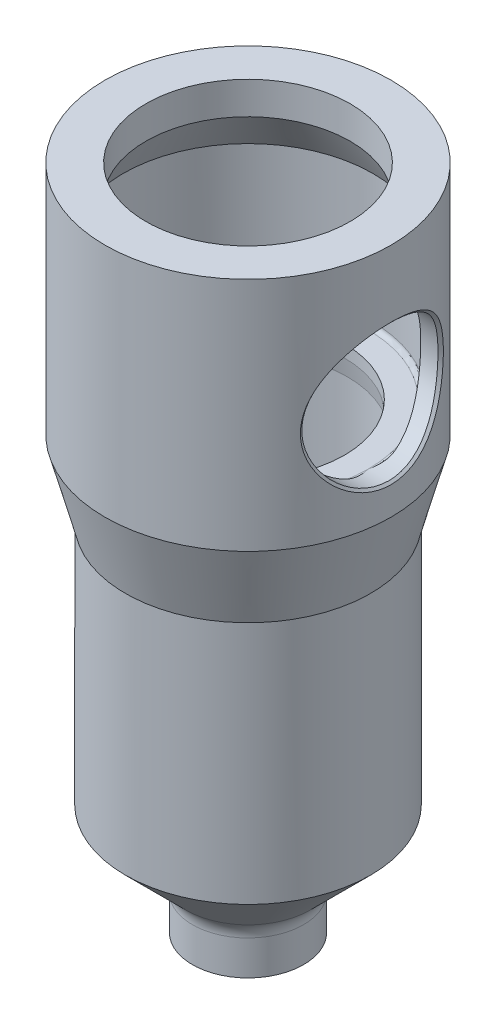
ISO-10303-21;
HEADER;
FILE_DESCRIPTION(('STEP AP214'),'2;1');
FILE_NAME('part.step','',(''),(''),'','','');
FILE_SCHEMA(('AUTOMOTIVE_DESIGN { 1 0 10303 214 1 1 1 1 }'));
ENDSEC;
DATA;
#1=APPLICATION_CONTEXT('core data for automotive mechanical design processes');
#2=APPLICATION_PROTOCOL_DEFINITION('international standard','automotive_design',2000,#1);
#3=PRODUCT_CONTEXT('',#1,'mechanical');
#4=PRODUCT('Part','Part','',(#3));
#5=PRODUCT_RELATED_PRODUCT_CATEGORY('part','',(#4));
#6=PRODUCT_DEFINITION_FORMATION('','',#4);
#7=PRODUCT_DEFINITION_CONTEXT('part definition',#1,'design');
#8=PRODUCT_DEFINITION('design','',#6,#7);
#9=PRODUCT_DEFINITION_SHAPE('','',#8);
#10=(LENGTH_UNIT() NAMED_UNIT(*) SI_UNIT(.MILLI.,.METRE.));
#11=(NAMED_UNIT(*) PLANE_ANGLE_UNIT() SI_UNIT($,.RADIAN.));
#12=(NAMED_UNIT(*) SI_UNIT($,.STERADIAN.) SOLID_ANGLE_UNIT());
#13=UNCERTAINTY_MEASURE_WITH_UNIT(LENGTH_MEASURE(1.E-05),#10,'distance_accuracy_value','');
#14=(GEOMETRIC_REPRESENTATION_CONTEXT(3) GLOBAL_UNCERTAINTY_ASSIGNED_CONTEXT((#13)) GLOBAL_UNIT_ASSIGNED_CONTEXT((#10,
#11,#12)) REPRESENTATION_CONTEXT('',''));
#15=CARTESIAN_POINT('',(0.,0.,0.));
#16=DIRECTION('',(0.,0.,1.));
#17=DIRECTION('',(1.,0.,0.));
#18=AXIS2_PLACEMENT_3D('',#15,#16,#17);
#19=CARTESIAN_POINT('',(0.,-215.459427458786,0.));
#20=DIRECTION('',(0.,-1.,0.));
#21=DIRECTION('',(0.,0.,-1.));
#22=AXIS2_PLACEMENT_3D('',#19,#20,#21);
#23=CYLINDRICAL_SURFACE('',#22,315.);
#24=CARTESIAN_POINT('',(314.999999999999,1012.00001302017,0.));
#25=CARTESIAN_POINT('',(315.000144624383,1011.99972860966,-5.27957504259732));
#26=CARTESIAN_POINT('',(314.865750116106,1012.26377931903,-10.5702434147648));
#27=CARTESIAN_POINT('',(314.344985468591,1013.29265392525,-20.9551467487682));
#28=CARTESIAN_POINT('',(313.958762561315,1014.05720947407,-26.0939023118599));
#29=CARTESIAN_POINT('',(312.949743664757,1016.07335186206,-36.2416799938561));
#30=CARTESIAN_POINT('',(312.326074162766,1017.32668015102,-41.2592536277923));
#31=CARTESIAN_POINT('',(310.858562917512,1020.31532273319,-51.1577800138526));
#32=CARTESIAN_POINT('',(310.006519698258,1022.06769626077,-56.079389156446));
#33=CARTESIAN_POINT('',(308.118958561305,1026.01997661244,-65.6617013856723));
#34=CARTESIAN_POINT('',(307.092186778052,1028.20135453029,-70.2906273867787));
#35=CARTESIAN_POINT('',(304.896228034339,1032.97209166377,-79.2760137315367));
#36=CARTESIAN_POINT('',(303.728148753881,1035.55894893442,-83.6269207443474));
#37=CARTESIAN_POINT('',(301.280836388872,1041.13211526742,-92.0549733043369));
#38=CARTESIAN_POINT('',(300.002359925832,1044.11646229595,-96.1292551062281));
#39=CARTESIAN_POINT('',(297.359824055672,1050.50275410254,-104.01674447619));
#40=CARTESIAN_POINT('',(296.000537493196,1053.89498799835,-107.813004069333));
#41=CARTESIAN_POINT('',(291.931422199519,1064.49414774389,-118.57204753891));
#42=CARTESIAN_POINT('',(289.205796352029,1072.16777161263,-124.996058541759));
#43=CARTESIAN_POINT('',(285.312176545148,1084.65768036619,-133.535841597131));
#44=CARTESIAN_POINT('',(284.043666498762,1089.0045448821,-136.204245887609));
#45=CARTESIAN_POINT('',(281.657536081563,1097.89292288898,-141.07205926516));
#46=CARTESIAN_POINT('',(280.535570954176,1102.4452674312,-143.282217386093));
#47=CARTESIAN_POINT('',(278.472748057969,1111.76876848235,-147.251256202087));
#48=CARTESIAN_POINT('',(277.531097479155,1116.54496702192,-149.011755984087));
#49=CARTESIAN_POINT('',(275.869102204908,1126.31430146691,-152.066670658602));
#50=CARTESIAN_POINT('',(275.145721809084,1131.34479873,-153.366579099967));
#51=CARTESIAN_POINT('',(273.403377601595,1146.49427398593,-156.464252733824));
#52=CARTESIAN_POINT('',(272.799059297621,1156.6873066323,-157.49824412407));
#53=CARTESIAN_POINT('',(272.797497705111,1172.19252000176,-157.500836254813));
#54=CARTESIAN_POINT('',(272.95334961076,1177.42594336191,-157.231785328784));
#55=CARTESIAN_POINT('',(273.559753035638,1187.71882132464,-156.174386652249));
#56=CARTESIAN_POINT('',(274.006936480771,1192.78385440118,-155.391718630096));
#57=CARTESIAN_POINT('',(275.161986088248,1202.76519331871,-153.337117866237));
#58=CARTESIAN_POINT('',(275.869446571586,1207.68069039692,-152.06581759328));
#59=CARTESIAN_POINT('',(277.514892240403,1217.3667216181,-149.041760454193));
#60=CARTESIAN_POINT('',(278.451437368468,1222.1305591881,-147.291742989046));
#61=CARTESIAN_POINT('',(280.531725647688,1231.54165456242,-143.29012751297));
#62=CARTESIAN_POINT('',(281.662902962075,1236.12770668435,-141.061305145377));
#63=CARTESIAN_POINT('',(284.035414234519,1244.96407853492,-136.220886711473));
#64=CARTESIAN_POINT('',(285.282195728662,1249.2388029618,-133.598908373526));
#65=CARTESIAN_POINT('',(287.854297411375,1257.50397272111,-127.962862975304));
#66=CARTESIAN_POINT('',(289.181241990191,1261.49917737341,-124.945130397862));
#67=CARTESIAN_POINT('',(291.874247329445,1269.20428642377,-118.518456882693));
#68=CARTESIAN_POINT('',(293.250325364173,1272.939797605,-115.083013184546));
#69=CARTESIAN_POINT('',(295.974770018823,1280.03937740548,-107.882874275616));
#70=CARTESIAN_POINT('',(297.318497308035,1283.39439225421,-104.13313605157));
#71=CARTESIAN_POINT('',(299.941699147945,1289.73979620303,-96.3170017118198));
#72=CARTESIAN_POINT('',(301.220735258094,1292.72840582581,-92.249903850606));
#73=CARTESIAN_POINT('',(304.9088058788,1301.13479738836,-79.584413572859));
#74=CARTESIAN_POINT('',(307.186870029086,1306.02872185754,-70.3982454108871));
#75=CARTESIAN_POINT('',(310.922102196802,1313.84904243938,-51.4266225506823));
#76=CARTESIAN_POINT('',(312.424520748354,1316.87733867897,-41.5183195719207));
#77=CARTESIAN_POINT('',(314.481567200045,1320.98726796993,-20.8415785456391));
#78=CARTESIAN_POINT('',(314.998267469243,1321.99656182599,-10.4253757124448));
#79=CARTESIAN_POINT('',(315.001731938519,1322.003410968,10.4526926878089));
#80=CARTESIAN_POINT('',(314.464611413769,1320.95374691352,21.0747667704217));
#81=CARTESIAN_POINT('',(312.919300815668,1317.86570962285,36.5127694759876));
#82=CARTESIAN_POINT('',(312.278679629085,1316.57775411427,41.6238972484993));
#83=CARTESIAN_POINT('',(310.786058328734,1313.53598113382,51.5980546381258));
#84=CARTESIAN_POINT('',(309.938795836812,1311.79180072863,56.4460391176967));
#85=CARTESIAN_POINT('',(308.067300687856,1307.87047343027,65.8996377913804));
#86=CARTESIAN_POINT('',(307.043583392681,1305.69451343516,70.501994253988));
#87=CARTESIAN_POINT('',(304.846451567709,1300.91824398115,79.4666195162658));
#88=CARTESIAN_POINT('',(303.673543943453,1298.3191889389,83.8263726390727));
#89=CARTESIAN_POINT('',(301.201116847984,1292.68370967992,92.3174456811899));
#90=CARTESIAN_POINT('',(299.902824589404,1289.64816319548,96.4387713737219));
#91=CARTESIAN_POINT('',(297.272734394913,1283.28121949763,104.263375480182));
#92=CARTESIAN_POINT('',(295.930341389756,1279.92608024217,108.003443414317));
#93=CARTESIAN_POINT('',(293.231476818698,1272.88813876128,115.129593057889));
#94=CARTESIAN_POINT('',(291.872824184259,1269.19980735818,118.521541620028));
#95=CARTESIAN_POINT('',(289.178339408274,1261.49128047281,124.952369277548));
#96=CARTESIAN_POINT('',(287.834912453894,1257.44650504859,128.007641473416));
#97=CARTESIAN_POINT('',(283.93149200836,1244.88862450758,136.553915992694));
#98=CARTESIAN_POINT('',(281.5302328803,1236.06837654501,141.370878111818));
#99=CARTESIAN_POINT('',(278.434287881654,1222.04805407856,147.323986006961));
#100=CARTESIAN_POINT('',(277.485754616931,1217.21748097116,149.096237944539));
#101=CARTESIAN_POINT('',(275.827200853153,1207.40878175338,152.14249347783));
#102=CARTESIAN_POINT('',(275.120446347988,1202.45741007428,153.411571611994));
#103=CARTESIAN_POINT('',(273.972688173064,1192.43324223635,155.45203845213));
#104=CARTESIAN_POINT('',(273.532309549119,1187.35948634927,156.222375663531));
#105=CARTESIAN_POINT('',(272.941824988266,1177.11584957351,157.25173854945));
#106=CARTESIAN_POINT('',(272.792112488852,1171.89456294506,157.510198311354));
#107=CARTESIAN_POINT('',(272.804257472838,1161.50981378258,157.489168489));
#108=CARTESIAN_POINT('',(272.962598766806,1156.3796005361,157.21573188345));
#109=CARTESIAN_POINT('',(273.566583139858,1146.20355424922,156.162399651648));
#110=CARTESIAN_POINT('',(274.0120012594,1141.1636170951,155.38281511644));
#111=CARTESIAN_POINT('',(275.169643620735,1131.17749262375,153.323389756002));
#112=CARTESIAN_POINT('',(275.880630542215,1126.2387809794,152.045775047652));
#113=CARTESIAN_POINT('',(277.552861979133,1116.42490622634,148.971449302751));
#114=CARTESIAN_POINT('',(278.503521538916,1111.61492532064,147.193137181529));
#115=CARTESIAN_POINT('',(281.60015816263,1097.66356464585,141.231633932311));
#116=CARTESIAN_POINT('',(284.000250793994,1088.87954450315,136.407728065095));
#117=CARTESIAN_POINT('',(287.869713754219,1076.44702171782,127.929181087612));
#118=CARTESIAN_POINT('',(289.211238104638,1072.41060790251,124.876776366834));
#119=CARTESIAN_POINT('',(291.923696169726,1064.6587571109,118.397118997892));
#120=CARTESIAN_POINT('',(293.283594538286,1060.97223527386,114.996985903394));
#121=CARTESIAN_POINT('',(295.983889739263,1053.93814651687,107.856849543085));
#122=CARTESIAN_POINT('',(297.322944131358,1050.59463070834,104.120413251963));
#123=CARTESIAN_POINT('',(299.945322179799,1044.25166104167,96.3056780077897));
#124=CARTESIAN_POINT('',(301.22785925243,1041.25421171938,92.2303481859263));
#125=CARTESIAN_POINT('',(304.94712978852,1032.78016980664,79.4428293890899));
#126=CARTESIAN_POINT('',(307.181157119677,1027.98438008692,70.4068954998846));
#127=CARTESIAN_POINT('',(309.986492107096,1022.10924204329,56.1888361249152));
#128=CARTESIAN_POINT('',(310.832427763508,1020.36882317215,51.3202216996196));
#129=CARTESIAN_POINT('',(312.320367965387,1017.33803275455,41.3112695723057));
#130=CARTESIAN_POINT('',(312.951280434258,1016.07023834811,36.2332308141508));
#131=CARTESIAN_POINT('',(313.964822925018,1014.04514336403,26.0258998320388));
#132=CARTESIAN_POINT('',(314.350262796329,1013.28221299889,20.8781187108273));
#133=CARTESIAN_POINT('',(314.86772291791,1012.25989635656,10.5022326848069));
#134=CARTESIAN_POINT('',(314.999855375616,1012.00029743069,5.27957504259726));
#135=CARTESIAN_POINT('',(314.999999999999,1012.00001302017,0.));
#136=B_SPLINE_CURVE_WITH_KNOTS('',3,(#24,#25,#26,#27,#28,#29,#30,#31,#32,#33,#34,#35,#36,#37,
#38,#39,#40,#41,#42,#43,#44,#45,#46,#47,#48,#49,#50,#51,#52,#53,#54,#55,#56,#57,#58,#59,#60,#61,
#62,#63,#64,#65,#66,#67,#68,#69,#70,#71,#72,#73,#74,#75,#76,#77,#78,#79,#80,#81,#82,#83,#84,#85,
#86,#87,#88,#89,#90,#91,#92,#93,#94,#95,#96,#97,#98,#99,#100,#101,#102,#103,#104,#105,#106,#107,
#108,#109,#110,#111,#112,#113,#114,#115,#116,#117,#118,#119,#120,#121,#122,#123,#124,#125,#126,
#127,#128,#129,#130,#131,#132,#133,#134,#135),.UNSPECIFIED.,.T.,.F.,(4,2,2,2,2,2,2,2,2,2,2,2,2,
2,2,2,2,2,2,2,2,2,2,2,2,2,2,2,2,2,2,2,2,2,2,2,2,2,2,2,2,2,2,2,2,2,2,2,2,2,2,2,2,2,2,4),
(-0.925906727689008,-0.910552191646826,-0.895197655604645,-0.879843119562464,-0.864488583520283,
-0.849134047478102,-0.83377951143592,-0.818424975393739,-0.803070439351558,-0.772361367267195,
-0.757006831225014,-0.741652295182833,-0.726297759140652,-0.71094322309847,-0.680234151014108,
-0.664879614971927,-0.649525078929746,-0.634170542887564,-0.618816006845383,-0.603461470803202,
-0.588106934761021,-0.572752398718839,-0.557397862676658,-0.542043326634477,-0.526688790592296,
-0.495979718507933,-0.465270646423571,-0.434561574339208,-0.403852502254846,-0.388497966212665,
-0.373143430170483,-0.357788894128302,-0.342434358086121,-0.32707982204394,-0.311725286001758,
-0.296370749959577,-0.281016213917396,-0.250307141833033,-0.234952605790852,-0.219598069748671,
-0.20424353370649,-0.188888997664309,-0.173534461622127,-0.158179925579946,-0.142825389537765,
-0.127470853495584,-0.0967617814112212,-0.0814072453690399,-0.0660527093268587,
-0.0506981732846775,-0.0353436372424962,-0.00463456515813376,0.0107199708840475,
0.0260745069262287,0.0414290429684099,0.0567835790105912),.UNSPECIFIED.);
#137=CARTESIAN_POINT('',(314.999999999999,1012.00001302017,0.));
#138=VERTEX_POINT('',#137);
#139=EDGE_CURVE('E170',#138,#138,#136,.F.);
#140=ORIENTED_EDGE('',*,*,#139,.T.);
#141=EDGE_LOOP('',(#140));
#142=FACE_BOUND('',#141,.T.);
#143=CARTESIAN_POINT('',(0.,949.942286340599,0.));
#144=DIRECTION('',(0.,-1.,0.));
#145=DIRECTION('',(0.,0.,-1.));
#146=AXIS2_PLACEMENT_3D('',#143,#144,#145);
#147=CIRCLE('',#146,315.);
#148=CARTESIAN_POINT('',(0.,949.942286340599,-315.));
#149=VERTEX_POINT('',#148);
#150=EDGE_CURVE('E219',#149,#149,#147,.T.);
#151=ORIENTED_EDGE('',*,*,#150,.F.);
#152=EDGE_LOOP('',(#151));
#153=FACE_BOUND('',#152,.T.);
#154=CARTESIAN_POINT('',(0.,1469.,0.));
#155=DIRECTION('',(0.,-1.,0.));
#156=DIRECTION('',(0.,0.,-1.));
#157=AXIS2_PLACEMENT_3D('',#154,#155,#156);
#158=CIRCLE('',#157,315.);
#159=CARTESIAN_POINT('',(0.,1469.,-315.));
#160=VERTEX_POINT('',#159);
#161=EDGE_CURVE('E76',#160,#160,#158,.T.);
#162=ORIENTED_EDGE('',*,*,#161,.T.);
#163=EDGE_LOOP('',(#162));
#164=FACE_BOUND('',#163,.T.);
#165=ADVANCED_FACE('F29',(#142,#153,#164),#23,.T.);
#166=CARTESIAN_POINT('',(0.,-115.865867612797,0.));
#167=DIRECTION('',(0.,-1.,0.));
#168=DIRECTION('',(0.,0.,-1.));
#169=AXIS2_PLACEMENT_3D('',#166,#167,#168);
#170=CYLINDRICAL_SURFACE('',#169,275.);
#171=CARTESIAN_POINT('',(0.,1310.89745962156,0.));
#172=DIRECTION('',(0.,-1.,0.));
#173=DIRECTION('',(0.,0.,-1.));
#174=AXIS2_PLACEMENT_3D('',#171,#172,#173);
#175=CIRCLE('',#174,275.);
#176=CARTESIAN_POINT('',(271.719485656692,1310.89745962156,42.3499836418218));
#177=VERTEX_POINT('',#176);
#178=CARTESIAN_POINT('',(271.719485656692,1310.89745962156,-42.3499836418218));
#179=VERTEX_POINT('',#178);
#180=EDGE_CURVE('E222',#177,#179,#175,.T.);
#181=ORIENTED_EDGE('',*,*,#180,.F.);
#182=CARTESIAN_POINT('',(271.719485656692,1310.89745962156,42.3499836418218));
#183=CARTESIAN_POINT('',(271.560747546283,1310.59771417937,43.3684645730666));
#184=CARTESIAN_POINT('',(271.396760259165,1310.28738830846,44.3829693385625));
#185=CARTESIAN_POINT('',(271.058579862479,1309.64581372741,46.4036154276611));
#186=CARTESIAN_POINT('',(270.8843868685,1309.31456525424,47.4097568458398));
#187=CARTESIAN_POINT('',(270.346988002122,1308.2898881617,50.4147437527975));
#188=CARTESIAN_POINT('',(269.968912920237,1307.56543492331,52.4004674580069));
#189=CARTESIAN_POINT('',(269.176086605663,1306.03665826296,56.331632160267));
#190=CARTESIAN_POINT('',(268.761362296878,1305.23239342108,58.2771014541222));
#191=CARTESIAN_POINT('',(267.897785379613,1303.54577307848,62.1262174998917));
#192=CARTESIAN_POINT('',(267.448932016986,1302.66341585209,64.0298633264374));
#193=CARTESIAN_POINT('',(266.522066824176,1300.82689494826,67.7842954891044));
#194=CARTESIAN_POINT('',(266.044188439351,1299.87305578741,69.6352736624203));
#195=CARTESIAN_POINT('',(265.060589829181,1297.8925323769,73.290282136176));
#196=CARTESIAN_POINT('',(264.55486916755,1296.86584698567,75.0943117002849));
#197=CARTESIAN_POINT('',(263.518671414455,1294.74173105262,78.6533248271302));
#198=CARTESIAN_POINT('',(262.988190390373,1293.64428926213,80.4083005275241));
#199=CARTESIAN_POINT('',(261.905800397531,1291.38101138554,83.8667688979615));
#200=CARTESIAN_POINT('',(261.353891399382,1290.21517520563,85.57026149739));
#201=CARTESIAN_POINT('',(260.233537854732,1287.82057292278,88.9191469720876));
#202=CARTESIAN_POINT('',(259.665143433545,1286.59199038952,90.5646879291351));
#203=CARTESIAN_POINT('',(258.513699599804,1284.07087819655,93.8009450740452));
#204=CARTESIAN_POINT('',(257.930648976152,1282.77834324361,95.3916567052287));
#205=CARTESIAN_POINT('',(256.753460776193,1280.1315360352,98.5162264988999));
#206=CARTESIAN_POINT('',(256.159324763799,1278.77727245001,100.050092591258));
#207=CARTESIAN_POINT('',(254.963400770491,1276.00868851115,103.059630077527));
#208=CARTESIAN_POINT('',(254.361612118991,1274.5943628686,104.535296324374));
#209=CARTESIAN_POINT('',(252.548124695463,1270.25917697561,108.87741142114));
#210=CARTESIAN_POINT('',(251.330131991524,1267.25017844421,111.654173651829));
#211=CARTESIAN_POINT('',(248.907587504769,1261.01195375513,116.955152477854));
#212=CARTESIAN_POINT('',(247.703036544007,1257.78271421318,119.479353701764));
#213=CARTESIAN_POINT('',(245.888894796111,1252.66868536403,123.149048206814));
#214=CARTESIAN_POINT('',(245.263177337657,1250.85720830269,124.389705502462));
#215=CARTESIAN_POINT('',(244.029507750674,1247.17733586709,126.792834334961));
#216=CARTESIAN_POINT('',(243.421553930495,1245.30894594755,127.955313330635));
#217=CARTESIAN_POINT('',(242.228352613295,1241.51720275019,130.200004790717));
#218=CARTESIAN_POINT('',(241.643107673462,1239.59384332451,131.282208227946));
#219=CARTESIAN_POINT('',(240.500483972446,1235.69466634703,133.363889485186));
#220=CARTESIAN_POINT('',(239.943106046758,1233.71884722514,134.363364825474));
#221=CARTESIAN_POINT('',(238.861912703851,1229.71934645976,136.276162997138));
#222=CARTESIAN_POINT('',(238.338066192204,1227.69571161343,137.189566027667));
#223=CARTESIAN_POINT('',(237.328578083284,1223.60201418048,138.928603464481));
#224=CARTESIAN_POINT('',(236.842931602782,1221.53195757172,139.754249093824));
#225=CARTESIAN_POINT('',(235.914863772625,1217.3486082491,141.315256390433));
#226=CARTESIAN_POINT('',(235.472440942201,1215.23531701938,142.050621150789));
#227=CARTESIAN_POINT('',(234.635725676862,1210.96928331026,143.428470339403));
#228=CARTESIAN_POINT('',(234.241432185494,1208.816541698,144.07095680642));
#229=CARTESIAN_POINT('',(233.531476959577,1204.62851545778,145.218704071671));
#230=CARTESIAN_POINT('',(233.212236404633,1202.59560978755,145.730435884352));
#231=CARTESIAN_POINT('',(232.622789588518,1198.50335773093,146.669510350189));
#232=CARTESIAN_POINT('',(232.352582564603,1196.44401175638,147.096854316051));
#233=CARTESIAN_POINT('',(231.864242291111,1192.30322999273,147.865413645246));
#234=CARTESIAN_POINT('',(231.646107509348,1190.22179485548,148.206631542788));
#235=CARTESIAN_POINT('',(231.264447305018,1186.04144873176,148.801479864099));
#236=CARTESIAN_POINT('',(231.100921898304,1183.94253774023,149.055110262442));
#237=CARTESIAN_POINT('',(230.830585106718,1179.73434162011,149.473419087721));
#238=CARTESIAN_POINT('',(230.723717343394,1177.62506892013,149.638185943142));
#239=CARTESIAN_POINT('',(230.567761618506,1173.39928313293,149.878376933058));
#240=CARTESIAN_POINT('',(230.518674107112,1171.28276998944,149.953800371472));
#241=CARTESIAN_POINT('',(230.478892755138,1167.04812517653,150.014936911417));
#242=CARTESIAN_POINT('',(230.488192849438,1164.92999369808,150.000659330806));
#243=CARTESIAN_POINT('',(230.565059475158,1160.69734369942,149.882482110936));
#244=CARTESIAN_POINT('',(230.632623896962,1158.58282505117,149.778585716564));
#245=CARTESIAN_POINT('',(230.811056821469,1154.67192332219,149.503439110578));
#246=CARTESIAN_POINT('',(230.914131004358,1152.8743166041,149.344286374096));
#247=CARTESIAN_POINT('',(231.161174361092,1149.28878925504,148.961617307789));
#248=CARTESIAN_POINT('',(231.305143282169,1147.50086856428,148.738101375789));
#249=CARTESIAN_POINT('',(231.632699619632,1143.93804133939,148.227475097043));
#250=CARTESIAN_POINT('',(231.81628188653,1142.1631331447,147.940373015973));
#251=CARTESIAN_POINT('',(232.22151750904,1138.62897958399,147.303459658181));
#252=CARTESIAN_POINT('',(232.443171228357,1136.86973436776,146.953647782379));
#253=CARTESIAN_POINT('',(232.922776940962,1133.36926096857,146.19227882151));
#254=CARTESIAN_POINT('',(233.18073677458,1131.62803676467,145.780708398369));
#255=CARTESIAN_POINT('',(233.730895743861,1128.16635306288,144.896995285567));
#256=CARTESIAN_POINT('',(234.023097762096,1126.44589532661,144.424847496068));
#257=CARTESIAN_POINT('',(234.639488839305,1123.02825017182,143.421257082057));
#258=CARTESIAN_POINT('',(234.963676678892,1121.33106186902,142.88981671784));
#259=CARTESIAN_POINT('',(235.641716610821,1117.9618307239,141.768862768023));
#260=CARTESIAN_POINT('',(235.995571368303,1116.28979015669,141.179343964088));
#261=CARTESIAN_POINT('',(236.741746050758,1112.92197705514,139.92460336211));
#262=CARTESIAN_POINT('',(237.134912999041,1111.22705016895,139.257613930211));
#263=CARTESIAN_POINT('',(237.94737296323,1107.86786536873,137.864780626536));
#264=CARTESIAN_POINT('',(238.366668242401,1106.20361012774,137.138931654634));
#265=CARTESIAN_POINT('',(239.659477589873,1101.25974992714,134.875330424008));
#266=CARTESIAN_POINT('',(240.568084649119,1098.02829506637,133.251241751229));
#267=CARTESIAN_POINT('',(242.456643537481,1091.70497955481,129.783189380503));
#268=CARTESIAN_POINT('',(243.436644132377,1088.61321670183,127.939074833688));
#269=CARTESIAN_POINT('',(245.445474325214,1082.58099179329,124.041627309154));
#270=CARTESIAN_POINT('',(246.474306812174,1079.6405387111,121.988281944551));
#271=CARTESIAN_POINT('',(248.722172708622,1073.47351096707,117.34534690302));
#272=CARTESIAN_POINT('',(249.945824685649,1070.27393310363,114.722085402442));
#273=CARTESIAN_POINT('',(252.398266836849,1064.10245534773,109.220795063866));
#274=CARTESIAN_POINT('',(253.627057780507,1061.1305909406,106.342726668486));
#275=CARTESIAN_POINT('',(255.45030526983,1056.85684303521,101.846735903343));
#276=CARTESIAN_POINT('',(256.054525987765,1055.46338481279,100.318816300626));
#277=CARTESIAN_POINT('',(257.252937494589,1052.7390242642,97.2044682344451));
#278=CARTESIAN_POINT('',(257.84712914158,1051.40811656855,95.6180448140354));
#279=CARTESIAN_POINT('',(259.021789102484,1048.81104878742,92.3886607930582));
#280=CARTESIAN_POINT('',(259.602259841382,1047.544877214,90.7457103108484));
#281=CARTESIAN_POINT('',(260.746032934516,1045.07917991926,87.4049399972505));
#282=CARTESIAN_POINT('',(261.309336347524,1043.87965008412,85.707123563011));
#283=CARTESIAN_POINT('',(262.610343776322,1041.13849852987,81.650504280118));
#284=CARTESIAN_POINT('',(263.339535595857,1039.62532592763,79.2696546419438));
#285=CARTESIAN_POINT('',(264.751849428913,1036.73051842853,74.4166787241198));
#286=CARTESIAN_POINT('',(265.434982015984,1035.34885331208,71.9445735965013));
#287=CARTESIAN_POINT('',(266.419229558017,1033.37916022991,68.1724600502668));
#288=CARTESIAN_POINT('',(266.74059403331,1032.73968339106,66.90432658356));
#289=CARTESIAN_POINT('',(267.36891084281,1031.49567252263,64.3474802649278));
#290=CARTESIAN_POINT('',(267.675863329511,1030.89113812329,63.0587676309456));
#291=CARTESIAN_POINT('',(268.274527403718,1029.71752820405,60.461184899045));
#292=CARTESIAN_POINT('',(268.566233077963,1029.14846642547,59.1523072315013));
#293=CARTESIAN_POINT('',(269.133394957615,1028.04674678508,56.5157955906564));
#294=CARTESIAN_POINT('',(269.408850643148,1027.51409008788,55.1881610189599));
#295=CARTESIAN_POINT('',(269.675731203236,1027.,53.8516480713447));
#296=B_SPLINE_CURVE_WITH_KNOTS('',3,(#182,#183,#184,#185,#186,#187,#188,#189,#190,#191,#192,
#193,#194,#195,#196,#197,#198,#199,#200,#201,#202,#203,#204,#205,#206,#207,#208,#209,#210,#211,
#212,#213,#214,#215,#216,#217,#218,#219,#220,#221,#222,#223,#224,#225,#226,#227,#228,#229,#230,
#231,#232,#233,#234,#235,#236,#237,#238,#239,#240,#241,#242,#243,#244,#245,#246,#247,#248,#249,
#250,#251,#252,#253,#254,#255,#256,#257,#258,#259,#260,#261,#262,#263,#264,#265,#266,#267,#268,
#269,#270,#271,#272,#273,#274,#275,#276,#277,#278,#279,#280,#281,#282,#283,#284,#285,#286,#287,
#288,#289,#290,#291,#292,#293,#294,#295),.UNSPECIFIED.,.F.,.F.,(4,2,2,2,2,2,2,2,2,2,2,2,2,2,2,2,
2,2,2,2,2,2,2,2,2,2,2,2,2,2,2,2,2,2,2,2,2,2,2,2,2,2,2,2,2,2,2,2,2,2,2,2,2,2,2,2,4),(0.,
3.22027134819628,6.44050623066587,12.8799790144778,19.3147598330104,25.7496828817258,
32.1569816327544,38.5643808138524,44.9728011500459,51.3812302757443,57.7718795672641,
64.1630586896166,70.5533428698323,76.9441909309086,89.7454995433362,102.547586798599,
109.394857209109,116.241473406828,123.088858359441,129.936448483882,136.777593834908,
143.617863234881,150.457898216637,157.297783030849,163.656929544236,170.01597712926,
176.374837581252,182.733699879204,189.086222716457,195.438795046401,201.790707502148,
208.14238997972,213.563532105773,218.984640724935,224.405045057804,229.825501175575,
235.247129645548,240.669214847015,246.091093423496,251.513459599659,257.102178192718,
262.691381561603,273.867322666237,285.050970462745,296.235280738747,309.165634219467,
322.097998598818,328.559717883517,335.020881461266,341.480894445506,347.940508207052,
356.676974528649,365.411428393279,369.779347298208,374.147219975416,378.516774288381,
382.886468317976),.UNSPECIFIED.);
#297=CARTESIAN_POINT('',(269.675731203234,1027.00000000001,53.8516480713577));
#298=VERTEX_POINT('',#297);
#299=EDGE_CURVE('E50',#177,#298,#296,.T.);
#300=ORIENTED_EDGE('',*,*,#299,.T.);
#301=CARTESIAN_POINT('',(0.,1027.,0.));
#302=DIRECTION('',(0.,1.,0.));
#303=DIRECTION('',(0.,0.,1.));
#304=AXIS2_PLACEMENT_3D('',#301,#302,#303);
#305=CIRCLE('',#304,275.);
#306=CARTESIAN_POINT('',(269.675731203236,1027.,-53.8516480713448));
#307=VERTEX_POINT('',#306);
#308=EDGE_CURVE('E69',#298,#307,#305,.F.);
#309=ORIENTED_EDGE('',*,*,#308,.T.);
#310=CARTESIAN_POINT('',(269.675731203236,1027.,-53.8516480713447));
#311=CARTESIAN_POINT('',(269.273069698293,1027.77568031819,-55.8682898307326));
#312=CARTESIAN_POINT('',(268.850849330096,1028.59364364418,-57.8646651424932));
#313=CARTESIAN_POINT('',(267.97047629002,1030.31158061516,-61.8135047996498));
#314=CARTESIAN_POINT('',(267.512327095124,1031.21154632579,-63.7659733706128));
#315=CARTESIAN_POINT('',(266.563519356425,1033.0904563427,-67.6227256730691));
#316=CARTESIAN_POINT('',(266.072882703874,1034.06934756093,-69.5270406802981));
#317=CARTESIAN_POINT('',(265.062140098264,1036.10417073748,-73.2860804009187));
#318=CARTESIAN_POINT('',(264.542033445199,1037.16010452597,-75.1408039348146));
#319=CARTESIAN_POINT('',(263.477256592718,1039.34354470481,-78.7930434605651));
#320=CARTESIAN_POINT('',(262.932657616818,1040.47084701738,-80.5907023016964));
#321=CARTESIAN_POINT('',(261.821079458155,1042.79725518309,-84.1318384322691));
#322=CARTESIAN_POINT('',(261.254099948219,1043.99636208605,-85.8753149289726));
#323=CARTESIAN_POINT('',(260.101277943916,1046.46425699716,-89.3062193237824));
#324=CARTESIAN_POINT('',(259.515432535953,1047.73305578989,-90.9936384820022));
#325=CARTESIAN_POINT('',(258.328643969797,1050.33795580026,-94.3101996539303));
#326=CARTESIAN_POINT('',(257.727700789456,1051.67405711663,-95.939341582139));
#327=CARTESIAN_POINT('',(256.515960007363,1054.40810093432,-99.1336123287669));
#328=CARTESIAN_POINT('',(255.905190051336,1055.80588446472,-100.698887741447));
#329=CARTESIAN_POINT('',(254.676129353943,1058.66442796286,-103.768019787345));
#330=CARTESIAN_POINT('',(254.057837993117,1060.12519314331,-105.271871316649));
#331=CARTESIAN_POINT('',(252.817732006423,1063.10753363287,-108.216199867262));
#332=CARTESIAN_POINT('',(252.195917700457,1064.6291034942,-109.656682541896));
#333=CARTESIAN_POINT('',(250.952687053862,1067.731320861,-112.472742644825));
#334=CARTESIAN_POINT('',(250.331270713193,1069.31196836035,-113.848320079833));
#335=CARTESIAN_POINT('',(249.091992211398,1072.53289755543,-116.534848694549));
#336=CARTESIAN_POINT('',(248.474136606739,1074.17326338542,-117.845702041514));
#337=CARTESIAN_POINT('',(247.247078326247,1077.50964214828,-120.398872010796));
#338=CARTESIAN_POINT('',(246.637875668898,1079.20565520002,-121.641188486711));
#339=CARTESIAN_POINT('',(245.43233881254,1082.6516830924,-124.055584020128));
#340=CARTESIAN_POINT('',(244.836005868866,1084.40170316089,-125.227656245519));
#341=CARTESIAN_POINT('',(243.660691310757,1087.9535531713,-127.499423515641));
#342=CARTESIAN_POINT('',(243.081708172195,1089.75537853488,-128.599124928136));
#343=CARTESIAN_POINT('',(241.920070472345,1093.49074487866,-130.771801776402));
#344=CARTESIAN_POINT('',(241.338409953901,1095.42657254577,-131.841381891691));
#345=CARTESIAN_POINT('',(240.204038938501,1099.35011731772,-133.896966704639));
#346=CARTESIAN_POINT('',(239.651325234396,1101.33782863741,-134.882980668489));
#347=CARTESIAN_POINT('',(238.57986613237,1105.36302605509,-136.769237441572));
#348=CARTESIAN_POINT('',(238.061127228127,1107.40052156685,-137.669463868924));
#349=CARTESIAN_POINT('',(237.062982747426,1111.52159228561,-139.381217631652));
#350=CARTESIAN_POINT('',(236.583571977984,1113.60516136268,-140.192756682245));
#351=CARTESIAN_POINT('',(235.669834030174,1117.81180155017,-141.723401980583));
#352=CARTESIAN_POINT('',(235.235435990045,1119.93480417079,-142.442653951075));
#353=CARTESIAN_POINT('',(234.415738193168,1124.21963160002,-143.787628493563));
#354=CARTESIAN_POINT('',(234.030438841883,1126.38145672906,-144.413350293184));
#355=CARTESIAN_POINT('',(233.313599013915,1130.73909400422,-145.56863238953));
#356=CARTESIAN_POINT('',(232.982049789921,1132.93490055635,-146.098208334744));
#357=CARTESIAN_POINT('',(232.376816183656,1137.35580545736,-147.058960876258));
#358=CARTESIAN_POINT('',(232.103129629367,1139.58090270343,-147.490141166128));
#359=CARTESIAN_POINT('',(231.645597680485,1143.79351721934,-148.207543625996));
#360=CARTESIAN_POINT('',(231.454992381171,1145.77842683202,-148.504814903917));
#361=CARTESIAN_POINT('',(231.123744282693,1149.76266505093,-149.019826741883));
#362=CARTESIAN_POINT('',(230.983100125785,1151.7619932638,-149.237569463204));
#363=CARTESIAN_POINT('',(230.753321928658,1155.77060316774,-149.592610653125));
#364=CARTESIAN_POINT('',(230.664184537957,1157.77988420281,-149.729914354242));
#365=CARTESIAN_POINT('',(230.538400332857,1161.80400357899,-149.923511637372));
#366=CARTESIAN_POINT('',(230.501753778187,1163.81884194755,-149.979804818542));
#367=CARTESIAN_POINT('',(230.481369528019,1167.84878296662,-150.01112842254));
#368=CARTESIAN_POINT('',(230.497615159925,1169.86388533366,-149.986184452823));
#369=CARTESIAN_POINT('',(230.58279536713,1173.89034307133,-149.855198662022));
#370=CARTESIAN_POINT('',(230.651730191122,1175.90169842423,-149.749156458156));
#371=CARTESIAN_POINT('',(230.841509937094,1179.91597065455,-149.456440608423));
#372=CARTESIAN_POINT('',(230.962352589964,1181.91888789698,-149.26977048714));
#373=CARTESIAN_POINT('',(231.254612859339,1185.91191388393,-148.816587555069));
#374=CARTESIAN_POINT('',(231.426029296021,1187.90202292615,-148.550076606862));
#375=CARTESIAN_POINT('',(231.794957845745,1191.63625371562,-147.973647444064));
#376=CARTESIAN_POINT('',(231.987167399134,1193.38223268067,-147.672300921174));
#377=CARTESIAN_POINT('',(232.408138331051,1196.85832194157,-147.008882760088));
#378=CARTESIAN_POINT('',(232.636902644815,1198.5884309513,-146.646806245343));
#379=CARTESIAN_POINT('',(233.129111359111,1202.02973324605,-145.863057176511));
#380=CARTESIAN_POINT('',(233.392548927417,1203.7409301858,-145.44139636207));
#381=CARTESIAN_POINT('',(233.952153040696,1207.14255606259,-144.539516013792));
#382=CARTESIAN_POINT('',(234.248322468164,1208.83298315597,-144.059291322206));
#383=CARTESIAN_POINT('',(234.871238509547,1212.19093592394,-143.04145320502));
#384=CARTESIAN_POINT('',(235.1979877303,1213.85845963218,-142.503834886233));
#385=CARTESIAN_POINT('',(235.879755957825,1217.16855000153,-141.372475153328));
#386=CARTESIAN_POINT('',(236.234777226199,1218.81111465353,-140.778729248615));
#387=CARTESIAN_POINT('',(237.338699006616,1223.69856373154,-138.915184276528));
#388=CARTESIAN_POINT('',(238.126548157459,1226.90368586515,-137.562931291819));
#389=CARTESIAN_POINT('',(239.857513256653,1233.46415688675,-134.523925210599));
#390=CARTESIAN_POINT('',(240.808151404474,1236.80879688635,-132.818425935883));
#391=CARTESIAN_POINT('',(242.783421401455,1243.34457902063,-129.172395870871));
#392=CARTESIAN_POINT('',(243.808056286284,1246.53571484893,-127.231855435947));
#393=CARTESIAN_POINT('',(245.907551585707,1252.75607745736,-123.125136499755));
#394=CARTESIAN_POINT('',(246.982456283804,1255.7851562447,-120.958756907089));
#395=CARTESIAN_POINT('',(249.15795869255,1261.66868365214,-116.411604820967));
#396=CARTESIAN_POINT('',(250.258557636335,1264.52312386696,-114.03082202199));
#397=CARTESIAN_POINT('',(251.993458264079,1268.87158300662,-110.121457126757));
#398=CARTESIAN_POINT('',(252.626981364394,1270.42783596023,-108.661116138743));
#399=CARTESIAN_POINT('',(253.89069763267,1273.47728340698,-105.674697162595));
#400=CARTESIAN_POINT('',(254.520891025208,1274.97048220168,-104.148623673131));
#401=CARTESIAN_POINT('',(255.773959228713,1277.89210984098,-101.032188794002));
#402=CARTESIAN_POINT('',(256.396832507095,1279.32052529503,-99.441814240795));
#403=CARTESIAN_POINT('',(257.631117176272,1282.1101961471,-96.1988434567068));
#404=CARTESIAN_POINT('',(258.242528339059,1283.47145020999,-94.5462459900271));
#405=CARTESIAN_POINT('',(259.4490899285,1286.12271700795,-91.1830957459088));
#406=CARTESIAN_POINT('',(260.044261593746,1287.41282529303,-89.4726259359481));
#407=CARTESIAN_POINT('',(261.215308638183,1289.92138840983,-85.9937823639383));
#408=CARTESIAN_POINT('',(261.791185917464,1291.13985030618,-84.2254143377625));
#409=CARTESIAN_POINT('',(262.919796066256,1293.50255355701,-80.6332687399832));
#410=CARTESIAN_POINT('',(263.472534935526,1294.64681419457,-78.8095057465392));
#411=CARTESIAN_POINT('',(264.551304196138,1296.85886475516,-75.1087365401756));
#412=CARTESIAN_POINT('',(265.07733691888,1297.92666135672,-73.2317349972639));
#413=CARTESIAN_POINT('',(266.201461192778,1300.18920976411,-69.0461395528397));
#414=CARTESIAN_POINT('',(266.792909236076,1301.36661045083,-66.7263394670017));
#415=CARTESIAN_POINT('',(267.92621635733,1303.60302488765,-62.0193661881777));
#416=CARTESIAN_POINT('',(268.468088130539,1304.66206896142,-59.6322104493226));
#417=CARTESIAN_POINT('',(269.496997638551,1306.65802318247,-54.794912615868));
#418=CARTESIAN_POINT('',(269.984022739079,1307.59490519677,-52.3447561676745));
#419=CARTESIAN_POINT('',(270.669462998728,1308.90523773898,-48.6274762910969));
#420=CARTESIAN_POINT('',(270.890474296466,1309.3262728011,-47.3810724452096));
#421=CARTESIAN_POINT('',(271.316854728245,1310.13613741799,-44.875159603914));
#422=CARTESIAN_POINT('',(271.522223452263,1310.52496612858,-43.6156502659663));
#423=CARTESIAN_POINT('',(271.719485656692,1310.89745962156,-42.3499836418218));
#424=B_SPLINE_CURVE_WITH_KNOTS('',3,(#310,#311,#312,#313,#314,#315,#316,#317,#318,#319,#320,
#321,#322,#323,#324,#325,#326,#327,#328,#329,#330,#331,#332,#333,#334,#335,#336,#337,#338,#339,
#340,#341,#342,#343,#344,#345,#346,#347,#348,#349,#350,#351,#352,#353,#354,#355,#356,#357,#358,
#359,#360,#361,#362,#363,#364,#365,#366,#367,#368,#369,#370,#371,#372,#373,#374,#375,#376,#377,
#378,#379,#380,#381,#382,#383,#384,#385,#386,#387,#388,#389,#390,#391,#392,#393,#394,#395,#396,
#397,#398,#399,#400,#401,#402,#403,#404,#405,#406,#407,#408,#409,#410,#411,#412,#413,#414,#415,
#416,#417,#418,#419,#420,#421,#422,#423),.UNSPECIFIED.,.F.,.F.,(4,2,2,2,2,2,2,2,2,2,2,2,2,2,2,2,
2,2,2,2,2,2,2,2,2,2,2,2,2,2,2,2,2,2,2,2,2,2,2,2,2,2,2,2,2,2,2,2,2,2,2,2,2,2,2,2,4),(0.,
6.59291324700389,13.1851892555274,19.7730674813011,26.3611022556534,32.9310822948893,
39.5011584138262,46.0722541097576,52.6433594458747,59.1984193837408,65.7540228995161,
72.3090403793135,78.8640571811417,85.4286964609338,91.9933497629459,98.5586405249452,
105.123352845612,111.981684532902,118.839254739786,125.698131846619,132.556101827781,
139.40310609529,146.250166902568,153.096112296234,159.941800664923,165.987871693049,
172.033778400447,178.079291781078,184.124835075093,190.168472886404,196.212139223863,
202.255541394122,208.298802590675,213.64390421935,218.989435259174,224.333914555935,
229.678864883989,235.024271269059,240.370105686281,251.060241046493,262.667680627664,
274.275596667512,285.89393835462,297.512838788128,304.189766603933,310.866238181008,
317.544083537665,324.222061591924,330.89084092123,337.558961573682,344.225342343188,
350.891140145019,358.890770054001,366.888345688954,374.88775986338,378.889380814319,
382.891106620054),.UNSPECIFIED.);
#425=EDGE_CURVE('E44',#307,#179,#424,.T.);
#426=ORIENTED_EDGE('',*,*,#425,.T.);
#427=EDGE_LOOP('',(#181,#300,#309,#426));
#428=FACE_BOUND('',#427,.T.);
#429=ADVANCED_FACE('F128',(#428),#170,.F.);
#430=CARTESIAN_POINT('',(0.,1397.5,0.));
#431=DIRECTION('',(0.,-1.,0.));
#432=DIRECTION('',(0.,0.,-1.));
#433=AXIS2_PLACEMENT_3D('',#430,#431,#432);
#434=CONICAL_SURFACE('',#433,225.,0.523598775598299);
#435=CARTESIAN_POINT('',(0.,1397.5,0.));
#436=DIRECTION('',(0.,-1.,0.));
#437=DIRECTION('',(0.,0.,-1.));
#438=AXIS2_PLACEMENT_3D('',#435,#436,#437);
#439=CIRCLE('',#438,225.);
#440=CARTESIAN_POINT('',(0.,1397.5,-225.));
#441=VERTEX_POINT('',#440);
#442=EDGE_CURVE('E237',#441,#441,#439,.T.);
#443=ORIENTED_EDGE('',*,*,#442,.F.);
#444=EDGE_LOOP('',(#443));
#445=FACE_BOUND('',#444,.T.);
#446=ORIENTED_EDGE('',*,*,#180,.T.);
#447=CARTESIAN_POINT('',(271.753813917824,1310.28700558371,-44.3715452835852));
#448=CARTESIAN_POINT('',(271.735613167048,1310.60233204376,-43.3532758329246));
#449=CARTESIAN_POINT('',(271.71876402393,1310.90680035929,-42.3316554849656));
#450=CARTESIAN_POINT('',(271.687496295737,1311.4938975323,-40.2821294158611));
#451=CARTESIAN_POINT('',(271.673077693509,1311.77652654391,-39.2542237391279));
#452=CARTESIAN_POINT('',(271.633059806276,1312.5914469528,-36.1617931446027));
#453=CARTESIAN_POINT('',(271.610696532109,1313.09080583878,-34.0884444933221));
#454=CARTESIAN_POINT('',(271.572695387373,1314.00071207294,-29.9221962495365));
#455=CARTESIAN_POINT('',(271.55705803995,1314.41125251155,-27.8292951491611));
#456=CARTESIAN_POINT('',(271.530924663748,1315.14273813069,-23.6278580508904));
#457=CARTESIAN_POINT('',(271.520428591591,1315.4636840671,-21.5193221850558));
#458=CARTESIAN_POINT('',(271.503535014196,1316.00859100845,-17.3425912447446));
#459=CARTESIAN_POINT('',(271.497042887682,1316.23474698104,-15.2746824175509));
#460=CARTESIAN_POINT('',(271.486910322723,1316.60087252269,-11.1312357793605));
#461=CARTESIAN_POINT('',(271.483269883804,1316.74084210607,-9.0556979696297));
#462=CARTESIAN_POINT('',(271.478314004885,1316.93433335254,-4.90099268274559));
#463=CARTESIAN_POINT('',(271.476998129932,1316.98787118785,-2.82182595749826));
#464=CARTESIAN_POINT('',(271.476486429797,1317.00845371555,1.33688674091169));
#465=CARTESIAN_POINT('',(271.477290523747,1316.97550170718,3.41643269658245));
#466=CARTESIAN_POINT('',(271.480733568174,1316.83956608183,7.12515747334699));
#467=CARTESIAN_POINT('',(271.482940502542,1316.7531760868,8.75496637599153));
#468=CARTESIAN_POINT('',(271.488945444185,1316.52725985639,12.010886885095));
#469=CARTESIAN_POINT('',(271.492743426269,1316.38773446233,13.6369985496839));
#470=CARTESIAN_POINT('',(271.50225173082,1316.05571047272,16.88365307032));
#471=CARTESIAN_POINT('',(271.50796188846,1315.86321644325,18.5041963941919));
#472=CARTESIAN_POINT('',(271.521738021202,1315.42547063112,21.7380269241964));
#473=CARTESIAN_POINT('',(271.529803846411,1315.18022220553,23.3513145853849));
#474=CARTESIAN_POINT('',(271.549040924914,1314.63183251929,26.6009559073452));
#475=CARTESIAN_POINT('',(271.560270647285,1314.32763864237,28.2371316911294));
#476=CARTESIAN_POINT('',(271.586482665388,1313.66498581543,31.4984252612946));
#477=CARTESIAN_POINT('',(271.601464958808,1313.30652689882,33.1235430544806));
#478=CARTESIAN_POINT('',(271.636016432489,1312.53567669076,36.3611905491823));
#479=CARTESIAN_POINT('',(271.655586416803,1312.12327595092,37.9737179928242));
#480=CARTESIAN_POINT('',(271.700286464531,1311.24507182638,41.1840946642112));
#481=CARTESIAN_POINT('',(271.725416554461,1310.77926818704,42.7819438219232));
#482=CARTESIAN_POINT('',(271.753813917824,1310.28700558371,44.3715452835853));
#483=B_SPLINE_CURVE_WITH_KNOTS('',3,(#447,#448,#449,#450,#451,#452,#453,#454,#455,#456,#457,
#458,#459,#460,#461,#462,#463,#464,#465,#466,#467,#468,#469,#470,#471,#472,#473,#474,#475,#476,
#477,#478,#479,#480,#481,#482),.UNSPECIFIED.,.F.,.F.,(4,2,2,2,2,2,2,2,2,2,2,2,2,2,2,2,2,4),(0.,
3.19826296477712,6.3965033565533,12.7926383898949,19.1892708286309,25.5858492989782,
31.8248070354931,38.0637637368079,44.3015529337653,50.5391041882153,55.4345730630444,
60.329964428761,65.2249339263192,70.1195920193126,75.111416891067,80.1032386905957,
85.0959360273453,90.0886571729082),.UNSPECIFIED.);
#484=EDGE_CURVE('E116',#179,#177,#483,.T.);
#485=ORIENTED_EDGE('',*,*,#484,.T.);
#486=EDGE_LOOP('',(#446,#485));
#487=FACE_BOUND('',#486,.T.);
#488=ADVANCED_FACE('F124',(#445,#487),#434,.F.);
#489=CARTESIAN_POINT('',(0.,1027.,0.));
#490=DIRECTION('',(0.,1.,0.));
#491=DIRECTION('',(0.,0.,1.));
#492=AXIS2_PLACEMENT_3D('',#489,#490,#491);
#493=TOROIDAL_SURFACE('',#492,265.,10.);
#494=CARTESIAN_POINT('',(265.,1017.,0.));
#495=CARTESIAN_POINT('',(265.006454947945,1016.99999999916,0.0249999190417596));
#496=CARTESIAN_POINT('',(265.012906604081,1017.00000624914,0.0500007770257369));
#497=CARTESIAN_POINT('',(265.854123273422,1017.00163720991,3.31159635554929));
#498=CARTESIAN_POINT('',(266.633568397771,1017.10803240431,6.56387711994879));
#499=CARTESIAN_POINT('',(268.042381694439,1017.53669002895,13.0936361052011));
#500=CARTESIAN_POINT('',(268.67145642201,1017.85936994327,16.3711509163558));
#501=CARTESIAN_POINT('',(269.581353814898,1018.60342229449,22.0018389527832));
#502=CARTESIAN_POINT('',(269.910350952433,1018.97106190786,24.3542411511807));
#503=CARTESIAN_POINT('',(270.312102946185,1019.6085584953,27.8781259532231));
#504=CARTESIAN_POINT('',(270.430751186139,1019.8354768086,29.0523146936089));
#505=CARTESIAN_POINT('',(270.634525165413,1020.31796609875,31.3976719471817));
#506=CARTESIAN_POINT('',(270.719653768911,1020.57353462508,32.5688407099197));
#507=CARTESIAN_POINT('',(270.8530379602,1021.1122809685,34.9027652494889));
#508=CARTESIAN_POINT('',(270.901417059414,1021.39536266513,36.0655360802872));
#509=CARTESIAN_POINT('',(270.958339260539,1021.98956826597,38.3849953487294));
#510=CARTESIAN_POINT('',(270.966879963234,1022.30069385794,39.5416834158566));
#511=CARTESIAN_POINT('',(270.94030029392,1022.95017042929,41.8458870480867));
#512=CARTESIAN_POINT('',(270.90521592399,1023.28849874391,42.9934093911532));
#513=CARTESIAN_POINT('',(270.787160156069,1023.99174205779,45.2776486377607));
#514=CARTESIAN_POINT('',(270.704199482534,1024.35665108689,46.4143679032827));
#515=CARTESIAN_POINT('',(270.543324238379,1024.91221198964,48.0767726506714));
#516=CARTESIAN_POINT('',(270.485926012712,1025.0930063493,48.6078092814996));
#517=CARTESIAN_POINT('',(270.358836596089,1025.46005020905,49.666451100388));
#518=CARTESIAN_POINT('',(270.289147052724,1025.64629897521,50.19405673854));
#519=CARTESIAN_POINT('',(270.136816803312,1026.02420657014,51.2458592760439));
#520=CARTESIAN_POINT('',(270.054167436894,1026.21586894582,51.7700536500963));
#521=CARTESIAN_POINT('',(269.87526612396,1026.60428387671,52.8143311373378));
#522=CARTESIAN_POINT('',(269.77901160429,1026.80103738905,53.3344134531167));
#523=CARTESIAN_POINT('',(269.67562737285,1027.0002,53.8521680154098));
#524=B_SPLINE_CURVE_WITH_KNOTS('',3,(#494,#495,#496,#497,#498,#499,#500,#501,#502,#503,#504,
#505,#506,#507,#508,#509,#510,#511,#512,#513,#514,#515,#516,#517,#518,#519,#520,#521,#522,#523),
.UNSPECIFIED.,.F.,.F.,(4,2,2,2,2,2,2,2,2,2,2,2,2,2,4),(0.,0.077459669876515,10.1049595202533,
20.1518709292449,27.3569448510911,30.9616165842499,34.5659802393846,38.1581757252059,
41.7505875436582,45.3400366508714,48.9286820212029,50.6202386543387,52.3115687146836,
54.004033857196,55.696819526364),.UNSPECIFIED.);
#525=CARTESIAN_POINT('',(265.,1017.,0.));
#526=VERTEX_POINT('',#525);
#527=EDGE_CURVE('E60',#526,#298,#524,.T.);
#528=ORIENTED_EDGE('',*,*,#527,.F.);
#529=CARTESIAN_POINT('',(0.,1017.,0.));
#530=DIRECTION('',(0.,1.,0.));
#531=DIRECTION('',(0.,0.,1.));
#532=AXIS2_PLACEMENT_3D('',#529,#530,#531);
#533=CIRCLE('',#532,265.);
#534=EDGE_CURVE('E65',#526,#526,#533,.T.);
#535=ORIENTED_EDGE('',*,*,#534,.F.);
#536=CARTESIAN_POINT('',(269.67562737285,1027.0002,-53.8521680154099));
#537=CARTESIAN_POINT('',(269.753236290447,1026.85070377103,-53.4635239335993));
#538=CARTESIAN_POINT('',(269.82682132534,1026.70256396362,-53.0735718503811));
#539=CARTESIAN_POINT('',(269.966235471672,1026.40910283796,-52.2912433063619));
#540=CARTESIAN_POINT('',(270.032064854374,1026.26378142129,-51.8988669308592));
#541=CARTESIAN_POINT('',(270.218333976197,1025.83225945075,-50.7185442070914));
#542=CARTESIAN_POINT('',(270.327593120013,1025.55042648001,-49.9272101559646));
#543=CARTESIAN_POINT('',(270.518256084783,1024.99949118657,-48.3379964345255));
#544=CARTESIAN_POINT('',(270.599695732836,1024.73037287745,-47.5401265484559));
#545=CARTESIAN_POINT('',(270.736795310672,1024.20498761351,-45.9379527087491));
#546=CARTESIAN_POINT('',(270.792453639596,1023.9487214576,-45.1336483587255));
#547=CARTESIAN_POINT('',(270.922981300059,1023.20192892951,-42.7193566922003));
#548=CARTESIAN_POINT('',(270.962181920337,1022.73106248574,-41.1012262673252));
#549=CARTESIAN_POINT('',(270.956994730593,1021.84406072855,-37.8496489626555));
#550=CARTESIAN_POINT('',(270.912566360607,1021.42795207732,-36.216195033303));
#551=CARTESIAN_POINT('',(270.760349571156,1020.70089081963,-33.1471451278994));
#552=CARTESIAN_POINT('',(270.661290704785,1020.38329465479,-31.7126693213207));
#553=CARTESIAN_POINT('',(270.412806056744,1019.7911008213,-28.8390781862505));
#554=CARTESIAN_POINT('',(270.263373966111,1019.51650854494,-27.399962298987));
#555=CARTESIAN_POINT('',(269.919297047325,1019.01027135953,-24.5189765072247));
#556=CARTESIAN_POINT('',(269.724632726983,1018.77864504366,-23.0771056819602));
#557=CARTESIAN_POINT('',(269.294851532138,1018.3583023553,-20.1932999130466));
#558=CARTESIAN_POINT('',(269.059736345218,1018.16958419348,-18.7513649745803));
#559=CARTESIAN_POINT('',(268.299688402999,1017.666942,-14.4247449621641));
#560=CARTESIAN_POINT('',(267.720389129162,1017.41699933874,-11.5419260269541));
#561=CARTESIAN_POINT('',(266.44815722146,1017.08429539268,-5.79374651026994));
#562=CARTESIAN_POINT('',(265.75528503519,1017.00144548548,-2.92837747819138));
#563=CARTESIAN_POINT('',(265.012906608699,1017.00000624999,-0.050000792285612));
#564=CARTESIAN_POINT('',(265.006454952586,1017.00000000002,-0.0249999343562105));
#565=CARTESIAN_POINT('',(265.,1017.,0.));
#566=B_SPLINE_CURVE_WITH_KNOTS('',3,(#536,#537,#538,#539,#540,#541,#542,#543,#544,#545,#546,
#547,#548,#549,#550,#551,#552,#553,#554,#555,#556,#557,#558,#559,#560,#561,#562,#563,#564,#565),
.UNSPECIFIED.,.F.,.F.,(4,2,2,2,2,2,2,2,2,2,2,2,2,2,4),(0.,1.27067590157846,2.54130734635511,
5.08193618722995,7.6192806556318,10.156782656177,15.2102251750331,20.2661192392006,
24.6822019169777,29.0988378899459,33.5173806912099,37.9357391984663,46.7806617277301,
55.6208918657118,55.6983515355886),.UNSPECIFIED.);
#567=EDGE_CURVE('E57',#307,#526,#566,.T.);
#568=ORIENTED_EDGE('',*,*,#567,.F.);
#569=ORIENTED_EDGE('',*,*,#308,.F.);
#570=EDGE_LOOP('',(#528,#535,#568,#569));
#571=FACE_BOUND('',#570,.T.);
#572=ADVANCED_FACE('F68',(#571),#493,.F.);
#573=CARTESIAN_POINT('',(0.,1469.,0.));
#574=DIRECTION('',(0.,-1.,0.));
#575=DIRECTION('',(0.,0.,-1.));
#576=AXIS2_PLACEMENT_3D('',#573,#574,#575);
#577=PLANE('',#576);
#578=ORIENTED_EDGE('',*,*,#161,.F.);
#579=EDGE_LOOP('',(#578));
#580=FACE_BOUND('',#579,.T.);
#581=CARTESIAN_POINT('',(0.,1469.,0.));
#582=DIRECTION('',(0.,-1.,0.));
#583=DIRECTION('',(0.,0.,-1.));
#584=AXIS2_PLACEMENT_3D('',#581,#582,#583);
#585=CIRCLE('',#584,225.);
#586=CARTESIAN_POINT('',(0.,1469.,-225.));
#587=VERTEX_POINT('',#586);
#588=EDGE_CURVE('E235',#587,#587,#585,.T.);
#589=ORIENTED_EDGE('',*,*,#588,.T.);
#590=EDGE_LOOP('',(#589));
#591=FACE_BOUND('',#590,.T.);
#592=ADVANCED_FACE('F31',(#580,#591),#577,.F.);
#593=CARTESIAN_POINT('',(-122.5,0.,0.));
#594=DIRECTION('',(0.,1.,0.));
#595=DIRECTION('',(0.,0.,1.));
#596=AXIS2_PLACEMENT_3D('',#593,#594,#595);
#597=PLANE('',#596);
#598=CARTESIAN_POINT('',(0.,0.,0.));
#599=DIRECTION('',(0.,-1.,0.));
#600=DIRECTION('',(0.,0.,-1.));
#601=AXIS2_PLACEMENT_3D('',#598,#599,#600);
#602=CIRCLE('',#601,122.5);
#603=CARTESIAN_POINT('',(0.,0.,-122.5));
#604=VERTEX_POINT('',#603);
#605=EDGE_CURVE('E216',#604,#604,#602,.T.);
#606=ORIENTED_EDGE('',*,*,#605,.T.);
#607=EDGE_LOOP('',(#606));
#608=FACE_BOUND('',#607,.T.);
#609=CARTESIAN_POINT('',(0.,0.,0.));
#610=DIRECTION('',(0.,-1.,0.));
#611=DIRECTION('',(0.,0.,-1.));
#612=AXIS2_PLACEMENT_3D('',#609,#610,#611);
#613=CIRCLE('',#612,92.5);
#614=CARTESIAN_POINT('',(0.,0.,-92.5));
#615=VERTEX_POINT('',#614);
#616=EDGE_CURVE('E238',#615,#615,#613,.T.);
#617=ORIENTED_EDGE('',*,*,#616,.F.);
#618=EDGE_LOOP('',(#617));
#619=FACE_BOUND('',#618,.T.);
#620=ADVANCED_FACE('F136',(#608,#619),#597,.F.);
#621=CARTESIAN_POINT('',(0.,949.942286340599,0.));
#622=DIRECTION('',(0.,1.,0.));
#623=DIRECTION('',(0.,0.,1.));
#624=AXIS2_PLACEMENT_3D('',#621,#622,#623);
#625=CONICAL_SURFACE('',#624,315.,0.26179938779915);
#626=CARTESIAN_POINT('',(0.,782.,0.));
#627=DIRECTION('',(0.,-1.,0.));
#628=DIRECTION('',(0.,0.,-1.));
#629=AXIS2_PLACEMENT_3D('',#626,#627,#628);
#630=CIRCLE('',#629,270.);
#631=CARTESIAN_POINT('',(0.,782.,-270.));
#632=VERTEX_POINT('',#631);
#633=EDGE_CURVE('E215',#632,#632,#630,.T.);
#634=ORIENTED_EDGE('',*,*,#633,.F.);
#635=EDGE_LOOP('',(#634));
#636=FACE_BOUND('',#635,.T.);
#637=ORIENTED_EDGE('',*,*,#150,.T.);
#638=EDGE_LOOP('',(#637));
#639=FACE_BOUND('',#638,.T.);
#640=ADVANCED_FACE('F140',(#636,#639),#625,.T.);
#641=CARTESIAN_POINT('',(0.,-215.459427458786,0.));
#642=DIRECTION('',(0.,-1.,0.));
#643=DIRECTION('',(0.,0.,-1.));
#644=AXIS2_PLACEMENT_3D('',#641,#642,#643);
#645=CYLINDRICAL_SURFACE('',#644,270.);
#646=CARTESIAN_POINT('',(0.,244.499999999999,0.));
#647=DIRECTION('',(0.,-1.,0.));
#648=DIRECTION('',(0.,0.,-1.));
#649=AXIS2_PLACEMENT_3D('',#646,#647,#648);
#650=CIRCLE('',#649,270.);
#651=CARTESIAN_POINT('',(0.,244.499999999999,-270.));
#652=VERTEX_POINT('',#651);
#653=EDGE_CURVE('E214',#652,#652,#650,.T.);
#654=ORIENTED_EDGE('',*,*,#653,.F.);
#655=EDGE_LOOP('',(#654));
#656=FACE_BOUND('',#655,.T.);
#657=ORIENTED_EDGE('',*,*,#633,.T.);
#658=EDGE_LOOP('',(#657));
#659=FACE_BOUND('',#658,.T.);
#660=ADVANCED_FACE('F149',(#656,#659),#645,.T.);
#661=CARTESIAN_POINT('',(0.,244.499999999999,0.));
#662=DIRECTION('',(0.,1.,0.));
#663=DIRECTION('',(0.,0.,1.));
#664=AXIS2_PLACEMENT_3D('',#661,#662,#663);
#665=CONICAL_SURFACE('',#664,270.,0.78539816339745);
#666=CARTESIAN_POINT('',(0.,111.644660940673,0.));
#667=DIRECTION('',(0.,1.,0.));
#668=DIRECTION('',(0.,0.,1.));
#669=AXIS2_PLACEMENT_3D('',#666,#667,#668);
#670=CIRCLE('',#669,137.144660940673);
#671=CARTESIAN_POINT('',(0.,111.644660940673,137.144660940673));
#672=VERTEX_POINT('',#671);
#673=EDGE_CURVE('E11',#672,#672,#670,.T.);
#674=ORIENTED_EDGE('',*,*,#673,.T.);
#675=EDGE_LOOP('',(#674));
#676=FACE_BOUND('',#675,.T.);
#677=ORIENTED_EDGE('',*,*,#653,.T.);
#678=EDGE_LOOP('',(#677));
#679=FACE_BOUND('',#678,.T.);
#680=ADVANCED_FACE('F145',(#676,#679),#665,.T.);
#681=CARTESIAN_POINT('',(0.,-215.459427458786,0.));
#682=DIRECTION('',(0.,-1.,0.));
#683=DIRECTION('',(0.,0.,-1.));
#684=AXIS2_PLACEMENT_3D('',#681,#682,#683);
#685=CYLINDRICAL_SURFACE('',#684,122.5);
#686=CARTESIAN_POINT('',(0.,76.2893218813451,0.));
#687=DIRECTION('',(0.,-1.,0.));
#688=DIRECTION('',(0.,0.,-1.));
#689=AXIS2_PLACEMENT_3D('',#686,#687,#688);
#690=CIRCLE('',#689,122.5);
#691=CARTESIAN_POINT('',(0.,76.2893218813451,-122.5));
#692=VERTEX_POINT('',#691);
#693=EDGE_CURVE('E37',#692,#692,#690,.T.);
#694=ORIENTED_EDGE('',*,*,#693,.T.);
#695=EDGE_LOOP('',(#694));
#696=FACE_BOUND('',#695,.T.);
#697=ORIENTED_EDGE('',*,*,#605,.F.);
#698=EDGE_LOOP('',(#697));
#699=FACE_BOUND('',#698,.T.);
#700=ADVANCED_FACE('F142',(#696,#699),#685,.T.);
#701=CARTESIAN_POINT('',(0.,-115.865867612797,0.));
#702=DIRECTION('',(0.,-1.,0.));
#703=DIRECTION('',(0.,0.,-1.));
#704=AXIS2_PLACEMENT_3D('',#701,#702,#703);
#705=CYLINDRICAL_SURFACE('',#704,225.);
#706=ORIENTED_EDGE('',*,*,#442,.T.);
#707=EDGE_LOOP('',(#706));
#708=FACE_BOUND('',#707,.T.);
#709=ORIENTED_EDGE('',*,*,#588,.F.);
#710=EDGE_LOOP('',(#709));
#711=FACE_BOUND('',#710,.T.);
#712=ADVANCED_FACE('F130',(#708,#711),#705,.F.);
#713=CARTESIAN_POINT('',(0.,-115.865867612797,0.));
#714=DIRECTION('',(0.,-1.,0.));
#715=DIRECTION('',(0.,0.,-1.));
#716=AXIS2_PLACEMENT_3D('',#713,#714,#715);
#717=CYLINDRICAL_SURFACE('',#716,92.5);
#718=ORIENTED_EDGE('',*,*,#616,.T.);
#719=EDGE_LOOP('',(#718));
#720=FACE_BOUND('',#719,.T.);
#721=CARTESIAN_POINT('',(0.,145.,0.));
#722=DIRECTION('',(0.,-1.,0.));
#723=DIRECTION('',(0.,0.,-1.));
#724=AXIS2_PLACEMENT_3D('',#721,#722,#723);
#725=CIRCLE('',#724,92.5);
#726=CARTESIAN_POINT('',(0.,145.,-92.5));
#727=VERTEX_POINT('',#726);
#728=EDGE_CURVE('E243',#727,#727,#725,.T.);
#729=ORIENTED_EDGE('',*,*,#728,.F.);
#730=EDGE_LOOP('',(#729));
#731=FACE_BOUND('',#730,.T.);
#732=ADVANCED_FACE('F309',(#720,#731),#717,.F.);
#733=CARTESIAN_POINT('',(0.,199.114736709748,0.));
#734=DIRECTION('',(0.,-1.,0.));
#735=DIRECTION('',(0.,0.,-1.));
#736=AXIS2_PLACEMENT_3D('',#733,#734,#735);
#737=CONICAL_SURFACE('',#736,78.,0.261799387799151);
#738=ORIENTED_EDGE('',*,*,#728,.T.);
#739=EDGE_LOOP('',(#738));
#740=FACE_BOUND('',#739,.T.);
#741=CARTESIAN_POINT('',(0.,199.114736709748,0.));
#742=DIRECTION('',(0.,-1.,0.));
#743=DIRECTION('',(0.,0.,-1.));
#744=AXIS2_PLACEMENT_3D('',#741,#742,#743);
#745=CIRCLE('',#744,78.);
#746=CARTESIAN_POINT('',(0.,199.114736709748,-78.));
#747=VERTEX_POINT('',#746);
#748=EDGE_CURVE('E251',#747,#747,#745,.T.);
#749=ORIENTED_EDGE('',*,*,#748,.F.);
#750=EDGE_LOOP('',(#749));
#751=FACE_BOUND('',#750,.T.);
#752=ADVANCED_FACE('F306',(#740,#751),#737,.F.);
#753=CARTESIAN_POINT('',(0.,-115.865867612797,0.));
#754=DIRECTION('',(0.,-1.,0.));
#755=DIRECTION('',(0.,0.,-1.));
#756=AXIS2_PLACEMENT_3D('',#753,#754,#755);
#757=CYLINDRICAL_SURFACE('',#756,78.);
#758=ORIENTED_EDGE('',*,*,#748,.T.);
#759=EDGE_LOOP('',(#758));
#760=FACE_BOUND('',#759,.T.);
#761=CARTESIAN_POINT('',(0.,264.,0.));
#762=DIRECTION('',(0.,-1.,0.));
#763=DIRECTION('',(0.,0.,-1.));
#764=AXIS2_PLACEMENT_3D('',#761,#762,#763);
#765=CIRCLE('',#764,78.);
#766=CARTESIAN_POINT('',(0.,264.,-78.));
#767=VERTEX_POINT('',#766);
#768=EDGE_CURVE('E254',#767,#767,#765,.T.);
#769=ORIENTED_EDGE('',*,*,#768,.F.);
#770=EDGE_LOOP('',(#769));
#771=FACE_BOUND('',#770,.T.);
#772=ADVANCED_FACE('F302',(#760,#771),#757,.F.);
#773=CARTESIAN_POINT('',(-78.,264.,0.));
#774=DIRECTION('',(0.,1.,0.));
#775=DIRECTION('',(0.,0.,1.));
#776=AXIS2_PLACEMENT_3D('',#773,#774,#775);
#777=PLANE('',#776);
#778=ORIENTED_EDGE('',*,*,#768,.T.);
#779=EDGE_LOOP('',(#778));
#780=FACE_BOUND('',#779,.T.);
#781=CARTESIAN_POINT('',(0.,264.,0.));
#782=DIRECTION('',(0.,-1.,0.));
#783=DIRECTION('',(0.,0.,-1.));
#784=AXIS2_PLACEMENT_3D('',#781,#782,#783);
#785=CIRCLE('',#784,212.5);
#786=CARTESIAN_POINT('',(0.,264.,-212.5));
#787=VERTEX_POINT('',#786);
#788=EDGE_CURVE('E257',#787,#787,#785,.T.);
#789=ORIENTED_EDGE('',*,*,#788,.F.);
#790=EDGE_LOOP('',(#789));
#791=FACE_BOUND('',#790,.T.);
#792=ADVANCED_FACE('F298',(#780,#791),#777,.T.);
#793=CARTESIAN_POINT('',(0.,-115.865867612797,0.));
#794=DIRECTION('',(0.,-1.,0.));
#795=DIRECTION('',(0.,0.,-1.));
#796=AXIS2_PLACEMENT_3D('',#793,#794,#795);
#797=CYLINDRICAL_SURFACE('',#796,212.5);
#798=ORIENTED_EDGE('',*,*,#788,.T.);
#799=EDGE_LOOP('',(#798));
#800=FACE_BOUND('',#799,.T.);
#801=CARTESIAN_POINT('',(0.,296.5,0.));
#802=DIRECTION('',(0.,-1.,0.));
#803=DIRECTION('',(0.,0.,-1.));
#804=AXIS2_PLACEMENT_3D('',#801,#802,#803);
#805=CIRCLE('',#804,212.5);
#806=CARTESIAN_POINT('',(0.,296.5,-212.5));
#807=VERTEX_POINT('',#806);
#808=EDGE_CURVE('E260',#807,#807,#805,.T.);
#809=ORIENTED_EDGE('',*,*,#808,.F.);
#810=EDGE_LOOP('',(#809));
#811=FACE_BOUND('',#810,.T.);
#812=ADVANCED_FACE('F294',(#800,#811),#797,.F.);
#813=CARTESIAN_POINT('',(0.,336.198972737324,0.));
#814=DIRECTION('',(0.,1.,0.));
#815=DIRECTION('',(0.,0.,1.));
#816=AXIS2_PLACEMENT_3D('',#813,#814,#815);
#817=CONICAL_SURFACE('',#816,219.5,0.174532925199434);
#818=ORIENTED_EDGE('',*,*,#808,.T.);
#819=EDGE_LOOP('',(#818));
#820=FACE_BOUND('',#819,.T.);
#821=CARTESIAN_POINT('',(0.,336.198972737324,0.));
#822=DIRECTION('',(0.,-1.,0.));
#823=DIRECTION('',(0.,0.,-1.));
#824=AXIS2_PLACEMENT_3D('',#821,#822,#823);
#825=CIRCLE('',#824,219.5);
#826=CARTESIAN_POINT('',(0.,336.198972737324,-219.5));
#827=VERTEX_POINT('',#826);
#828=EDGE_CURVE('E263',#827,#827,#825,.T.);
#829=ORIENTED_EDGE('',*,*,#828,.F.);
#830=EDGE_LOOP('',(#829));
#831=FACE_BOUND('',#830,.T.);
#832=ADVANCED_FACE('F290',(#820,#831),#817,.F.);
#833=CARTESIAN_POINT('',(0.,-115.865867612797,0.));
#834=DIRECTION('',(0.,-1.,0.));
#835=DIRECTION('',(0.,0.,-1.));
#836=AXIS2_PLACEMENT_3D('',#833,#834,#835);
#837=CYLINDRICAL_SURFACE('',#836,219.5);
#838=ORIENTED_EDGE('',*,*,#828,.T.);
#839=EDGE_LOOP('',(#838));
#840=FACE_BOUND('',#839,.T.);
#841=CARTESIAN_POINT('',(0.,950.301027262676,0.));
#842=DIRECTION('',(0.,-1.,0.));
#843=DIRECTION('',(0.,0.,-1.));
#844=AXIS2_PLACEMENT_3D('',#841,#842,#843);
#845=CIRCLE('',#844,219.5);
#846=CARTESIAN_POINT('',(0.,950.301027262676,-219.5));
#847=VERTEX_POINT('',#846);
#848=EDGE_CURVE('E266',#847,#847,#845,.T.);
#849=ORIENTED_EDGE('',*,*,#848,.F.);
#850=EDGE_LOOP('',(#849));
#851=FACE_BOUND('',#850,.T.);
#852=ADVANCED_FACE('F284',(#840,#851),#837,.F.);
#853=CARTESIAN_POINT('',(0.,990.,0.));
#854=DIRECTION('',(0.,-1.,0.));
#855=DIRECTION('',(0.,0.,-1.));
#856=AXIS2_PLACEMENT_3D('',#853,#854,#855);
#857=CONICAL_SURFACE('',#856,212.5,0.174532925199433);
#858=ORIENTED_EDGE('',*,*,#848,.T.);
#859=EDGE_LOOP('',(#858));
#860=FACE_BOUND('',#859,.T.);
#861=CARTESIAN_POINT('',(0.,990.,0.));
#862=DIRECTION('',(0.,-1.,0.));
#863=DIRECTION('',(0.,0.,-1.));
#864=AXIS2_PLACEMENT_3D('',#861,#862,#863);
#865=CIRCLE('',#864,212.5);
#866=CARTESIAN_POINT('',(0.,990.,-212.5));
#867=VERTEX_POINT('',#866);
#868=EDGE_CURVE('E268',#867,#867,#865,.T.);
#869=ORIENTED_EDGE('',*,*,#868,.F.);
#870=EDGE_LOOP('',(#869));
#871=FACE_BOUND('',#870,.T.);
#872=ADVANCED_FACE('F277',(#860,#871),#857,.F.);
#873=CARTESIAN_POINT('',(0.,-115.865867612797,0.));
#874=DIRECTION('',(0.,-1.,0.));
#875=DIRECTION('',(0.,0.,-1.));
#876=AXIS2_PLACEMENT_3D('',#873,#874,#875);
#877=CYLINDRICAL_SURFACE('',#876,212.5);
#878=ORIENTED_EDGE('',*,*,#868,.T.);
#879=EDGE_LOOP('',(#878));
#880=FACE_BOUND('',#879,.T.);
#881=CARTESIAN_POINT('',(0.,1017.,0.));
#882=DIRECTION('',(0.,-1.,0.));
#883=DIRECTION('',(0.,0.,-1.));
#884=AXIS2_PLACEMENT_3D('',#881,#882,#883);
#885=CIRCLE('',#884,212.5);
#886=CARTESIAN_POINT('',(0.,1017.,-212.5));
#887=VERTEX_POINT('',#886);
#888=EDGE_CURVE('E122',#887,#887,#885,.T.);
#889=ORIENTED_EDGE('',*,*,#888,.F.);
#890=EDGE_LOOP('',(#889));
#891=FACE_BOUND('',#890,.T.);
#892=ADVANCED_FACE('F275',(#880,#891),#877,.F.);
#893=CARTESIAN_POINT('',(-212.5,1017.,0.));
#894=DIRECTION('',(0.,1.,0.));
#895=DIRECTION('',(0.,0.,1.));
#896=AXIS2_PLACEMENT_3D('',#893,#894,#895);
#897=PLANE('',#896);
#898=ORIENTED_EDGE('',*,*,#534,.T.);
#899=EDGE_LOOP('',(#898));
#900=FACE_BOUND('',#899,.T.);
#901=ORIENTED_EDGE('',*,*,#888,.T.);
#902=EDGE_LOOP('',(#901));
#903=FACE_BOUND('',#902,.T.);
#904=ADVANCED_FACE('F73',(#900,#903),#897,.T.);
#905=CARTESIAN_POINT('',(315.,1167.,0.));
#906=DIRECTION('',(-1.,0.,0.));
#907=DIRECTION('',(0.,0.,1.));
#908=AXIS2_PLACEMENT_3D('',#905,#906,#907);
#909=CYLINDRICAL_SURFACE('',#908,150.);
#910=CARTESIAN_POINT('',(310.000024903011,1017.,0.));
#911=CARTESIAN_POINT('',(310.00001077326,1017.00002975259,1.45858535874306));
#912=CARTESIAN_POINT('',(309.989012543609,1017.02127662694,2.91717369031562));
#913=CARTESIAN_POINT('',(309.94519357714,1017.1060669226,5.82620603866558));
#914=CARTESIAN_POINT('',(309.912471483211,1017.16941915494,7.27665711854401));
#915=CARTESIAN_POINT('',(309.825469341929,1017.33804951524,10.1704489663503));
#916=CARTESIAN_POINT('',(309.771249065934,1017.44321140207,11.6137983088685));
#917=CARTESIAN_POINT('',(309.641582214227,1017.69492772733,14.4942628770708));
#918=CARTESIAN_POINT('',(309.566159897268,1017.84143486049,15.9313833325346));
#919=CARTESIAN_POINT('',(309.394333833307,1018.17565387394,18.7991074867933));
#920=CARTESIAN_POINT('',(309.2979366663,1018.36335283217,20.2297130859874));
#921=CARTESIAN_POINT('',(309.084437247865,1018.77984898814,23.08415268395));
#922=CARTESIAN_POINT('',(308.967324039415,1019.00866793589,24.5079826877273));
#923=CARTESIAN_POINT('',(308.712696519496,1019.5072014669,27.3487322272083));
#924=CARTESIAN_POINT('',(308.575153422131,1019.77697376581,28.7656390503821));
#925=CARTESIAN_POINT('',(308.279687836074,1020.35781040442,31.5936881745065));
#926=CARTESIAN_POINT('',(308.121700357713,1020.66900651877,33.0047966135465));
#927=CARTESIAN_POINT('',(307.785723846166,1021.33265068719,35.8203917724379));
#928=CARTESIAN_POINT('',(307.60766383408,1021.68524532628,37.2248354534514));
#929=CARTESIAN_POINT('',(307.232071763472,1022.43133855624,40.0248559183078));
#930=CARTESIAN_POINT('',(307.034481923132,1022.82495872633,41.4203925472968));
#931=CARTESIAN_POINT('',(306.620712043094,1023.65202134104,44.1980560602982));
#932=CARTESIAN_POINT('',(306.404517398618,1024.0854950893,45.5801714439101));
#933=CARTESIAN_POINT('',(305.955451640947,1024.98930967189,48.3231796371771));
#934=CARTESIAN_POINT('',(305.722651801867,1025.4594936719,49.6841358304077));
#935=CARTESIAN_POINT('',(305.241042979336,1026.43630117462,52.3846176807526));
#936=CARTESIAN_POINT('',(304.992291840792,1026.94279371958,53.7242009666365));
#937=CARTESIAN_POINT('',(304.47937000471,1027.991993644,56.3822059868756));
#938=CARTESIAN_POINT('',(304.215237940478,1028.53461074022,57.7006709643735));
#939=CARTESIAN_POINT('',(303.400367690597,1030.21646835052,61.6287799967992));
#940=CARTESIAN_POINT('',(302.827188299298,1031.40964876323,64.2109552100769));
#941=CARTESIAN_POINT('',(301.626832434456,1033.93825767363,69.3002639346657));
#942=CARTESIAN_POINT('',(300.999518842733,1035.2740495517,71.8071838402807));
#943=CARTESIAN_POINT('',(299.696634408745,1038.08666442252,76.7430899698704));
#944=CARTESIAN_POINT('',(299.020862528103,1039.56408466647,79.1716827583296));
#945=CARTESIAN_POINT('',(297.629457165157,1042.65242567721,83.9391952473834));
#946=CARTESIAN_POINT('',(296.913732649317,1044.26365577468,86.2778877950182));
#947=CARTESIAN_POINT('',(295.456819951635,1047.60174345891,90.8407237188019));
#948=CARTESIAN_POINT('',(294.71580386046,1049.32787491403,93.0654536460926));
#949=CARTESIAN_POINT('',(293.214809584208,1052.89371005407,97.404405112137));
#950=CARTESIAN_POINT('',(292.454888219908,1054.73309332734,99.5189097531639));
#951=CARTESIAN_POINT('',(290.922778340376,1058.5251192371,103.63919074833));
#952=CARTESIAN_POINT('',(290.150589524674,1060.47776465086,105.644964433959));
#953=CARTESIAN_POINT('',(288.600620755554,1064.49686026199,109.549010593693));
#954=CARTESIAN_POINT('',(287.822831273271,1066.56360811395,111.446972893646));
#955=CARTESIAN_POINT('',(286.268454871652,1070.81373403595,115.135489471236));
#956=CARTESIAN_POINT('',(285.491900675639,1072.99771524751,116.925362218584));
#957=CARTESIAN_POINT('',(283.955477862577,1077.46186075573,120.378339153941));
#958=CARTESIAN_POINT('',(283.195578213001,1079.74181799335,122.041696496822));
#959=CARTESIAN_POINT('',(282.076577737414,1083.22750058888,124.435404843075));
#960=CARTESIAN_POINT('',(281.708036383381,1084.39705078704,125.214417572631));
#961=CARTESIAN_POINT('',(280.979098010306,1086.75630694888,126.738865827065));
#962=CARTESIAN_POINT('',(280.618684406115,1087.94596114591,127.484373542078));
#963=CARTESIAN_POINT('',(279.551554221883,1091.54387667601,129.669221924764));
#964=CARTESIAN_POINT('',(278.85747832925,1093.98564536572,131.060016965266));
#965=CARTESIAN_POINT('',(277.513034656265,1098.95251972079,133.705990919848));
#966=CARTESIAN_POINT('',(276.862655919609,1101.4776042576,134.961203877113));
#967=CARTESIAN_POINT('',(275.926183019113,1105.32489350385,136.740470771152));
#968=CARTESIAN_POINT('',(275.620298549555,1106.61838901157,137.316745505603));
#969=CARTESIAN_POINT('',(275.022096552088,1109.2276193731,138.435421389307));
#970=CARTESIAN_POINT('',(274.729819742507,1110.54340668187,138.977722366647));
#971=CARTESIAN_POINT('',(274.160115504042,1113.19876029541,140.027413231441));
#972=CARTESIAN_POINT('',(273.882756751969,1114.53840410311,140.534644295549));
#973=CARTESIAN_POINT('',(273.344319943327,1117.23851011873,141.513012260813));
#974=CARTESIAN_POINT('',(273.083290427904,1118.59902069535,141.984042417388));
#975=CARTESIAN_POINT('',(272.579281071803,1121.33747901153,142.88814513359));
#976=CARTESIAN_POINT('',(272.336319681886,1122.71544293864,143.321178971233));
#977=CARTESIAN_POINT('',(271.870958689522,1125.47971727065,144.146259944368));
#978=CARTESIAN_POINT('',(271.648466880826,1126.86595691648,144.538492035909));
#979=CARTESIAN_POINT('',(271.224896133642,1129.64514562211,145.281590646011));
#980=CARTESIAN_POINT('',(271.023715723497,1131.03802651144,145.632654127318));
#981=CARTESIAN_POINT('',(270.643075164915,1133.83153726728,146.29403160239));
#982=CARTESIAN_POINT('',(270.46354688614,1135.2321275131,146.604473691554));
#983=CARTESIAN_POINT('',(270.126602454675,1138.0415084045,147.185100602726));
#984=CARTESIAN_POINT('',(269.969145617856,1139.45027884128,147.455359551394));
#985=CARTESIAN_POINT('',(269.676926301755,1142.27558547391,147.95536671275));
#986=CARTESIAN_POINT('',(269.54213696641,1143.6921103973,148.185162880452));
#987=CARTESIAN_POINT('',(269.295706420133,1146.53295933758,148.604150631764));
#988=CARTESIAN_POINT('',(269.184062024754,1147.95728225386,148.793347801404));
#989=CARTESIAN_POINT('',(268.984393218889,1150.81369228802,149.131072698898));
#990=CARTESIAN_POINT('',(268.896390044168,1152.24578521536,149.279563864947));
#991=CARTESIAN_POINT('',(268.744456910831,1155.11747483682,149.535628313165));
#992=CARTESIAN_POINT('',(268.680570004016,1156.55708034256,149.643128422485));
#993=CARTESIAN_POINT('',(268.577289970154,1159.44456988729,149.816704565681));
#994=CARTESIAN_POINT('',(268.537980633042,1160.89246544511,149.882638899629));
#995=CARTESIAN_POINT('',(268.484137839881,1163.79748068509,149.972868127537));
#996=CARTESIAN_POINT('',(268.469733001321,1165.2546094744,149.99694686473));
#997=CARTESIAN_POINT('',(268.466413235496,1168.17515448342,150.002511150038));
#998=CARTESIAN_POINT('',(268.477606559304,1169.63857118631,149.983815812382));
#999=CARTESIAN_POINT('',(268.525469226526,1172.56401151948,149.90362894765));
#1000=CARTESIAN_POINT('',(268.562142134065,1174.0260349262,149.842131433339));
#1001=CARTESIAN_POINT('',(268.660418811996,1176.94258713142,149.677005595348));
#1002=CARTESIAN_POINT('',(268.721949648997,1178.39712535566,149.57350051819));
#1003=CARTESIAN_POINT('',(268.86974846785,1181.29402082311,149.324493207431));
#1004=CARTESIAN_POINT('',(268.955891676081,1182.7364026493,149.179202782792));
#1005=CARTESIAN_POINT('',(269.152039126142,1185.61218967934,148.847586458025));
#1006=CARTESIAN_POINT('',(269.262000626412,1187.0456062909,148.661334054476));
#1007=CARTESIAN_POINT('',(269.505240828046,1189.90354201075,148.24799023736));
#1008=CARTESIAN_POINT('',(269.638503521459,1191.32806653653,148.020926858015));
#1009=CARTESIAN_POINT('',(269.92779053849,1194.16756408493,147.526239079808));
#1010=CARTESIAN_POINT('',(270.083812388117,1195.58253812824,147.258619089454));
#1011=CARTESIAN_POINT('',(270.417979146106,1198.402710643,146.683166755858));
#1012=CARTESIAN_POINT('',(270.596139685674,1199.80790145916,146.375305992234));
#1013=CARTESIAN_POINT('',(270.973995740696,1202.60908377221,145.719252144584));
#1014=CARTESIAN_POINT('',(271.173735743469,1204.00504971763,145.370975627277));
#1015=CARTESIAN_POINT('',(271.594224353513,1206.78845140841,144.633899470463));
#1016=CARTESIAN_POINT('',(271.815044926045,1208.17583937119,144.244960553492));
#1017=CARTESIAN_POINT('',(272.276981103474,1210.94149267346,143.42671296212));
#1018=CARTESIAN_POINT('',(272.518175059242,1212.31969855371,142.997247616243));
#1019=CARTESIAN_POINT('',(273.019268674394,1215.0614592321,142.099285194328));
#1020=CARTESIAN_POINT('',(273.279186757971,1216.42499803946,141.630749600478));
#1021=CARTESIAN_POINT('',(273.815910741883,1219.13332952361,140.656556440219));
#1022=CARTESIAN_POINT('',(274.092694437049,1220.47814410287,140.150947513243));
#1023=CARTESIAN_POINT('',(274.661650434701,1223.14495873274,139.10383078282));
#1024=CARTESIAN_POINT('',(274.953767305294,1224.46702073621,138.5624506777));
#1025=CARTESIAN_POINT('',(275.551828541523,1227.08882014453,137.445433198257));
#1026=CARTESIAN_POINT('',(275.857732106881,1228.38860949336,136.86989548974));
#1027=CARTESIAN_POINT('',(276.794736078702,1232.25538482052,135.092051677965));
#1028=CARTESIAN_POINT('',(277.445937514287,1234.79353410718,133.837037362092));
#1029=CARTESIAN_POINT('',(278.793836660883,1239.78941388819,131.187661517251));
#1030=CARTESIAN_POINT('',(279.490611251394,1242.24699741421,129.793062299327));
#1031=CARTESIAN_POINT('',(280.563001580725,1245.87015640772,127.599634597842));
#1032=CARTESIAN_POINT('',(280.925737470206,1247.06961772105,126.850008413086));
#1033=CARTESIAN_POINT('',(281.659962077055,1249.44969208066,125.315804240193));
#1034=CARTESIAN_POINT('',(282.031477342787,1250.63022289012,124.53111139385));
#1035=CARTESIAN_POINT('',(283.155416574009,1254.13567246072,122.128734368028));
#1036=CARTESIAN_POINT('',(283.917295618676,1256.42465548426,120.462626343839));
#1037=CARTESIAN_POINT('',(285.452187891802,1260.88911602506,117.01593528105));
#1038=CARTESIAN_POINT('',(286.225117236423,1263.0651467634,115.236029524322));
#1039=CARTESIAN_POINT('',(287.774270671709,1267.30580293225,111.564133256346));
#1040=CARTESIAN_POINT('',(288.550475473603,1269.37077229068,109.67253199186));
#1041=CARTESIAN_POINT('',(290.099093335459,1273.39082109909,105.777214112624));
#1042=CARTESIAN_POINT('',(290.871508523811,1275.34597078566,103.773570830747));
#1043=CARTESIAN_POINT('',(292.40573468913,1279.14694254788,99.6539510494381));
#1044=CARTESIAN_POINT('',(293.167523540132,1280.99255684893,97.5377746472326));
#1045=CARTESIAN_POINT('',(294.674676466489,1284.57575885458,93.1875284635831));
#1046=CARTESIAN_POINT('',(295.41991749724,1286.31264689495,90.9528381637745));
#1047=CARTESIAN_POINT('',(296.516309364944,1288.82605548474,87.5235783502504));
#1048=CARTESIAN_POINT('',(296.878528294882,1289.64927463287,86.3664870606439));
#1049=CARTESIAN_POINT('',(297.593420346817,1291.26122299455,84.0307831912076));
#1050=CARTESIAN_POINT('',(297.946117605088,1292.05004331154,82.8522408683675));
#1051=CARTESIAN_POINT('',(298.986041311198,1294.35892952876,79.2945560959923));
#1052=CARTESIAN_POINT('',(299.659381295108,1295.83119444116,76.8800150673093));
#1053=CARTESIAN_POINT('',(300.957834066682,1298.63528549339,71.9731603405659));
#1054=CARTESIAN_POINT('',(301.583145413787,1299.96769923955,69.4812341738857));
#1055=CARTESIAN_POINT('',(302.780812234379,1302.49272926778,64.4184273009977));
#1056=CARTESIAN_POINT('',(303.353225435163,1303.68549833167,61.8476368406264));
#1057=CARTESIAN_POINT('',(304.167701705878,1305.36759832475,57.9347169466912));
#1058=CARTESIAN_POINT('',(304.431995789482,1305.91077796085,56.6200713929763));
#1059=CARTESIAN_POINT('',(304.945437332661,1306.96154815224,53.9705851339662));
#1060=CARTESIAN_POINT('',(305.194554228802,1307.46906719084,52.6357100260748));
#1061=CARTESIAN_POINT('',(305.677013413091,1308.44812620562,49.9449840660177));
#1062=CARTESIAN_POINT('',(305.910301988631,1308.91954430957,48.5890792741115));
#1063=CARTESIAN_POINT('',(306.360565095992,1309.82622809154,45.8556673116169));
#1064=CARTESIAN_POINT('',(306.577462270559,1310.26132324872,44.4780907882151));
#1065=CARTESIAN_POINT('',(306.993495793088,1311.09329345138,41.7039311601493));
#1066=CARTESIAN_POINT('',(307.192573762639,1311.49004318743,40.3073017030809));
#1067=CARTESIAN_POINT('',(307.571895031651,1312.24385446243,37.4995591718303));
#1068=CARTESIAN_POINT('',(307.752122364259,1312.60088237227,36.0884349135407));
#1069=CARTESIAN_POINT('',(308.092799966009,1313.27402392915,33.2558704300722));
#1070=CARTESIAN_POINT('',(308.253273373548,1313.59018546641,31.8344443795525));
#1071=CARTESIAN_POINT('',(308.553548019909,1314.18063557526,28.9823177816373));
#1072=CARTESIAN_POINT('',(308.693370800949,1314.45496779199,27.5516285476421));
#1073=CARTESIAN_POINT('',(308.952178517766,1314.96202407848,24.6796283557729));
#1074=CARTESIAN_POINT('',(309.071143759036,1315.19470882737,23.2383086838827));
#1075=CARTESIAN_POINT('',(309.288057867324,1315.61832360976,20.3480224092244));
#1076=CARTESIAN_POINT('',(309.386007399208,1315.80925496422,18.8990560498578));
#1077=CARTESIAN_POINT('',(309.560564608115,1316.14902579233,15.9964634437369));
#1078=CARTESIAN_POINT('',(309.637194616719,1316.29790931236,14.542843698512));
#1079=CARTESIAN_POINT('',(309.768809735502,1316.55326604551,11.6339470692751));
#1080=CARTESIAN_POINT('',(309.8238393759,1316.65982651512,10.1786798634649));
#1081=CARTESIAN_POINT('',(309.911997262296,1316.83031665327,7.26949228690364));
#1082=CARTESIAN_POINT('',(309.945192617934,1316.89437695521,5.81558163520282));
#1083=CARTESIAN_POINT('',(309.989213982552,1316.97923367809,2.91210876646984));
#1084=CARTESIAN_POINT('',(310.000130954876,1317.00020603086,1.46255309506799));
#1085=CARTESIAN_POINT('',(309.99991853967,1316.99979336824,-1.43283808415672));
#1086=CARTESIAN_POINT('',(309.988845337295,1316.97851630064,-2.87867364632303));
#1087=CARTESIAN_POINT('',(309.945397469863,1316.89477687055,-5.7691067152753));
#1088=CARTESIAN_POINT('',(309.913018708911,1316.83230658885,-7.21370393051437));
#1089=CARTESIAN_POINT('',(309.826829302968,1316.66565295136,-10.1013364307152));
#1090=CARTESIAN_POINT('',(309.772996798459,1316.5614270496,-11.5443686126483));
#1091=CARTESIAN_POINT('',(309.643981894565,1316.31114698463,-14.4285527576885));
#1092=CARTESIAN_POINT('',(309.568759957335,1316.16501535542,-15.8696962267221));
#1093=CARTESIAN_POINT('',(309.396989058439,1315.83069794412,-18.7497860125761));
#1094=CARTESIAN_POINT('',(309.300382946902,1315.64239945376,-20.1887158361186));
#1095=CARTESIAN_POINT('',(309.085890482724,1315.22355505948,-23.0640658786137));
#1096=CARTESIAN_POINT('',(308.967929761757,1314.99286146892,-24.500459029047));
#1097=CARTESIAN_POINT('',(308.710746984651,1314.48903377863,-27.3703077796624));
#1098=CARTESIAN_POINT('',(308.571435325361,1314.21572072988,-28.8037239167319));
#1099=CARTESIAN_POINT('',(308.272599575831,1313.62827427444,-31.6586988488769));
#1100=CARTESIAN_POINT('',(308.113093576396,1313.31417739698,-33.080267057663));
#1101=CARTESIAN_POINT('',(307.775010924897,1312.64656296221,-35.9060647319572));
#1102=CARTESIAN_POINT('',(307.596508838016,1312.29319931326,-37.3103394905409));
#1103=CARTESIAN_POINT('',(307.221101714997,1311.54763614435,-40.1015986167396));
#1104=CARTESIAN_POINT('',(307.024251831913,1311.15555281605,-41.4886214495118));
#1105=CARTESIAN_POINT('',(306.612827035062,1310.33312562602,-44.2454256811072));
#1106=CARTESIAN_POINT('',(306.398289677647,1309.90286269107,-45.615236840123));
#1107=CARTESIAN_POINT('',(305.952174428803,1309.00468238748,-48.3376847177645));
#1108=CARTESIAN_POINT('',(305.720618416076,1308.5368132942,-49.6903409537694));
#1109=CARTESIAN_POINT('',(305.241102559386,1307.56389810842,-52.3784842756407));
#1110=CARTESIAN_POINT('',(304.993150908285,1307.05887056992,-53.7139795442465));
#1111=CARTESIAN_POINT('',(304.481619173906,1306.0125133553,-56.3682197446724));
#1112=CARTESIAN_POINT('',(304.218033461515,1305.47117059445,-57.6869584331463));
#1113=CARTESIAN_POINT('',(303.674598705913,1304.34967922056,-60.3100570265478));
#1114=CARTESIAN_POINT('',(303.394696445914,1303.76940257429,-61.6143512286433));
#1115=CARTESIAN_POINT('',(302.81959934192,1302.57073292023,-64.2076296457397));
#1116=CARTESIAN_POINT('',(302.524354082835,1301.95221279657,-65.4965437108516));
#1117=CARTESIAN_POINT('',(301.617215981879,1300.04078720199,-69.3387987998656));
#1118=CARTESIAN_POINT('',(300.985260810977,1298.69477002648,-71.8612288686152));
#1119=CARTESIAN_POINT('',(299.676835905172,1295.8698247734,-76.8139441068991));
#1120=CARTESIAN_POINT('',(299.000425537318,1294.39107302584,-79.2443455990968));
#1121=CARTESIAN_POINT('',(297.958238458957,1292.07714833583,-82.8116638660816));
#1122=CARTESIAN_POINT('',(297.607020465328,1291.29163851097,-83.9853186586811));
#1123=CARTESIAN_POINT('',(296.89678662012,1289.69047545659,-86.3068207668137));
#1124=CARTESIAN_POINT('',(296.53778268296,1288.87486710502,-87.4547027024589));
#1125=CARTESIAN_POINT('',(295.450104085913,1286.38249491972,-90.8603007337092));
#1126=CARTESIAN_POINT('',(294.710463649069,1284.65952299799,-93.0809870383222));
#1127=CARTESIAN_POINT('',(293.209156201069,1281.09277403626,-97.4206451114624));
#1128=CARTESIAN_POINT('',(292.447459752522,1279.24883095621,-99.539469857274));
#1129=CARTESIAN_POINT('',(290.907938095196,1275.43777096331,-103.678427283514));
#1130=CARTESIAN_POINT('',(290.130050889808,1273.47007940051,-105.698007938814));
#1131=CARTESIAN_POINT('',(288.569145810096,1269.4203369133,-109.626846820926));
#1132=CARTESIAN_POINT('',(287.786120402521,1267.33804325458,-111.535851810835));
#1133=CARTESIAN_POINT('',(286.230761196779,1263.08087564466,-115.222911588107));
#1134=CARTESIAN_POINT('',(285.458391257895,1260.90665018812,-117.001699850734));
#1135=CARTESIAN_POINT('',(283.93169780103,1256.46688677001,-120.43040385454));
#1136=CARTESIAN_POINT('',(283.177317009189,1254.20172586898,-122.080782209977));
#1137=CARTESIAN_POINT('',(281.693902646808,1249.57956465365,-125.253629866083));
#1138=CARTESIAN_POINT('',(280.96484105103,1247.22267243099,-126.776243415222));
#1139=CARTESIAN_POINT('',(279.539486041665,1242.4154926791,-129.693602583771));
#1140=CARTESIAN_POINT('',(278.843251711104,1239.96505011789,-131.088121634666));
#1141=CARTESIAN_POINT('',(277.490706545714,1234.96495328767,-133.749111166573));
#1142=CARTESIAN_POINT('',(276.834655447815,1232.41479903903,-135.014777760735));
#1143=CARTESIAN_POINT('',(275.890117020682,1228.52597366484,-136.808546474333));
#1144=CARTESIAN_POINT('',(275.581315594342,1227.21656885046,-137.390011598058));
#1145=CARTESIAN_POINT('',(274.978967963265,1224.58010326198,-138.51568184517));
#1146=CARTESIAN_POINT('',(274.685405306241,1223.2530635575,-139.059927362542));
#1147=CARTESIAN_POINT('',(274.115922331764,1220.58829884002,-140.108414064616));
#1148=CARTESIAN_POINT('',(273.839913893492,1219.25067268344,-140.612858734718));
#1149=CARTESIAN_POINT('',(273.306113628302,1216.56401932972,-141.582146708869));
#1150=CARTESIAN_POINT('',(273.048251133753,1215.21506223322,-142.047145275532));
#1151=CARTESIAN_POINT('',(272.55120638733,1212.50488225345,-142.938261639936));
#1152=CARTESIAN_POINT('',(272.311978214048,1211.14369937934,-143.364475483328));
#1153=CARTESIAN_POINT('',(271.852938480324,1208.40918187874,-144.178079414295));
#1154=CARTESIAN_POINT('',(271.633093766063,1207.03587260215,-144.565535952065));
#1155=CARTESIAN_POINT('',(271.21357039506,1204.27717921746,-145.301370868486));
#1156=CARTESIAN_POINT('',(271.013872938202,1202.89180770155,-145.649785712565));
#1157=CARTESIAN_POINT('',(270.635328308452,1200.1088834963,-146.307438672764));
#1158=CARTESIAN_POINT('',(270.45648228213,1198.71133014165,-146.616674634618));
#1159=CARTESIAN_POINT('',(270.120357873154,1195.90396029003,-147.195834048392));
#1160=CARTESIAN_POINT('',(269.963102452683,1194.49413240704,-147.465715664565));
#1161=CARTESIAN_POINT('',(269.670857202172,1191.66200244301,-147.965717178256));
#1162=CARTESIAN_POINT('',(269.535915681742,1190.23968014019,-148.195750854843));
#1163=CARTESIAN_POINT('',(269.288929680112,1187.38223891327,-148.615648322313));
#1164=CARTESIAN_POINT('',(269.176963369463,1185.94709308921,-148.805375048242));
#1165=CARTESIAN_POINT('',(268.976525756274,1183.06370812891,-149.144364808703));
#1166=CARTESIAN_POINT('',(268.888164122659,1181.61543912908,-149.293439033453));
#1167=CARTESIAN_POINT('',(268.736143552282,1178.70817818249,-149.549613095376));
#1168=CARTESIAN_POINT('',(268.672582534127,1177.24916644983,-149.656546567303));
#1169=CARTESIAN_POINT('',(268.57050334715,1174.32732376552,-149.82808893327));
#1170=CARTESIAN_POINT('',(268.531993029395,1172.86449176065,-149.892684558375));
#1171=CARTESIAN_POINT('',(268.480731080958,1169.94221332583,-149.978551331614));
#1172=CARTESIAN_POINT('',(268.467889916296,1168.48277292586,-149.999973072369));
#1173=CARTESIAN_POINT('',(268.467935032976,1165.57092014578,-150.000023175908));
#1174=CARTESIAN_POINT('',(268.480697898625,1164.11850771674,-149.978856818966));
#1175=CARTESIAN_POINT('',(268.531039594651,1161.21927303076,-149.895026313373));
#1176=CARTESIAN_POINT('',(268.568550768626,1159.7724463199,-149.832475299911));
#1177=CARTESIAN_POINT('',(268.668224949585,1156.88408817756,-149.665627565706));
#1178=CARTESIAN_POINT('',(268.730353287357,1155.4425521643,-149.561389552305));
#1179=CARTESIAN_POINT('',(268.878911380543,1152.56447553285,-149.311307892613));
#1180=CARTESIAN_POINT('',(268.965339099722,1151.1279345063,-149.165467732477));
#1181=CARTESIAN_POINT('',(269.162190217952,1148.25953839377,-148.832240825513));
#1182=CARTESIAN_POINT('',(269.272642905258,1146.8276912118,-148.644803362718));
#1183=CARTESIAN_POINT('',(269.517250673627,1143.9683908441,-148.228376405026));
#1184=CARTESIAN_POINT('',(269.651464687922,1142.54095777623,-147.99928355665));
#1185=CARTESIAN_POINT('',(269.943216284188,1139.6901028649,-147.4998720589));
#1186=CARTESIAN_POINT('',(270.10084011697,1138.26671658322,-147.229400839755));
#1187=CARTESIAN_POINT('',(270.43928572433,1135.42482242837,-146.646402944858));
#1188=CARTESIAN_POINT('',(270.620205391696,1134.00636268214,-146.33369851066));
#1189=CARTESIAN_POINT('',(271.00382335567,1131.17938157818,-145.667366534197));
#1190=CARTESIAN_POINT('',(271.206559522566,1129.77088217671,-145.313667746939));
#1191=CARTESIAN_POINT('',(271.632158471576,1126.96984337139,-144.567197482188));
#1192=CARTESIAN_POINT('',(271.854988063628,1125.57728177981,-144.174490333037));
#1193=CARTESIAN_POINT('',(272.319458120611,1122.81255428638,-143.351181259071));
#1194=CARTESIAN_POINT('',(272.561023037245,1121.44033058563,-142.920730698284));
#1195=CARTESIAN_POINT('',(273.061828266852,1118.71410049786,-142.022663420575));
#1196=CARTESIAN_POINT('',(273.321037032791,1117.36006652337,-141.555112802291));
#1197=CARTESIAN_POINT('',(273.85621153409,1114.67028915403,-140.583084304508));
#1198=CARTESIAN_POINT('',(274.132159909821,1113.33452851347,-140.078644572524));
#1199=CARTESIAN_POINT('',(274.69979281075,1110.6815282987,-139.033296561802));
#1200=CARTESIAN_POINT('',(274.991469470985,1109.36427987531,-138.492406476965));
#1201=CARTESIAN_POINT('',(275.589630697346,1106.74793615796,-137.374360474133));
#1202=CARTESIAN_POINT('',(275.896122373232,1105.44884997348,-136.797187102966));
#1203=CARTESIAN_POINT('',(276.837276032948,1101.57478331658,-135.009752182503));
#1204=CARTESIAN_POINT('',(277.492287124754,1099.02916454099,-133.746009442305));
#1205=CARTESIAN_POINT('',(278.850125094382,1094.00981007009,-131.074529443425));
#1206=CARTESIAN_POINT('',(279.553184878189,1091.53652174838,-129.666071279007));
#1207=CARTESIAN_POINT('',(280.633895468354,1087.89428088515,-127.453299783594));
#1208=CARTESIAN_POINT('',(280.998636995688,1086.69101463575,-126.698706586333));
#1209=CARTESIAN_POINT('',(281.73452923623,1084.31191389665,-125.15880684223));
#1210=CARTESIAN_POINT('',(282.105656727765,1083.13600628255,-124.373602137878));
#1211=CARTESIAN_POINT('',(283.22534294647,1079.65267942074,-121.976447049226));
#1212=CARTESIAN_POINT('',(283.98297856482,1077.38037637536,-120.317304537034));
#1213=CARTESIAN_POINT('',(285.511683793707,1072.94070656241,-116.879867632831));
#1214=CARTESIAN_POINT('',(286.282722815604,1070.77313500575,-115.101823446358));
#1215=CARTESIAN_POINT('',(287.831342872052,1066.54026599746,-111.425821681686));
#1216=CARTESIAN_POINT('',(288.608929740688,1064.47507433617,-109.527744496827));
#1217=CARTESIAN_POINT('',(289.773710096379,1061.45532669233,-106.593836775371));
#1218=CARTESIAN_POINT('',(290.162282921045,1060.46032280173,-105.599851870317));
#1219=CARTESIAN_POINT('',(290.938763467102,1058.49512114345,-103.579956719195));
#1220=CARTESIAN_POINT('',(291.326663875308,1057.52502448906,-102.553945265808));
#1221=CARTESIAN_POINT('',(292.486743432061,1054.65519543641,-99.4316379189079));
#1222=CARTESIAN_POINT('',(293.25426961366,1052.79858561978,-97.2936553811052));
#1223=CARTESIAN_POINT('',(294.763615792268,1049.21577235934,-92.9237094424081));
#1224=CARTESIAN_POINT('',(295.505554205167,1047.48890625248,-90.6923293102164));
#1225=CARTESIAN_POINT('',(296.95588208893,1044.16838441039,-86.1412645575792));
#1226=CARTESIAN_POINT('',(297.66442815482,1042.57407283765,-83.8221090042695));
#1227=CARTESIAN_POINT('',(299.042654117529,1039.51670149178,-79.0944199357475));
#1228=CARTESIAN_POINT('',(299.712405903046,1038.05339601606,-76.6860662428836));
#1229=CARTESIAN_POINT('',(301.007437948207,1035.25856378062,-71.7788346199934));
#1230=CARTESIAN_POINT('',(301.632673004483,1033.92717044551,-69.2798684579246));
#1231=CARTESIAN_POINT('',(302.531739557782,1032.03279403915,-65.4668977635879));
#1232=CARTESIAN_POINT('',(302.825369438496,1031.41762085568,-64.183207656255));
#1233=CARTESIAN_POINT('',(303.399580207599,1030.220685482,-61.5912151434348));
#1234=CARTESIAN_POINT('',(303.680106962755,1029.63905990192,-60.2828374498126));
#1235=CARTESIAN_POINT('',(304.227088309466,1028.51017919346,-57.6421998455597));
#1236=CARTESIAN_POINT('',(304.493483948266,1027.96306648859,-56.3098668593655));
#1237=CARTESIAN_POINT('',(305.01001107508,1026.90674964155,-53.6275760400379));
#1238=CARTESIAN_POINT('',(305.260147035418,1026.39753506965,-52.2776231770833));
#1239=CARTESIAN_POINT('',(305.74290713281,1025.41858296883,-49.5651358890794));
#1240=CARTESIAN_POINT('',(305.975582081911,1024.94873039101,-48.2026520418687));
#1241=CARTESIAN_POINT('',(306.422020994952,1024.05036907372,-45.4694242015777));
#1242=CARTESIAN_POINT('',(306.635880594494,1023.62165011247,-44.0987649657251));
#1243=CARTESIAN_POINT('',(307.044783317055,1022.80443193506,-41.3478906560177));
#1244=CARTESIAN_POINT('',(307.239887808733,1022.41580121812,-39.9677237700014));
#1245=CARTESIAN_POINT('',(307.611155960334,1021.67834164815,-37.1970908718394));
#1246=CARTESIAN_POINT('',(307.787354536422,1021.32943934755,-35.8066490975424));
#1247=CARTESIAN_POINT('',(308.120363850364,1020.67165134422,-33.0160277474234));
#1248=CARTESIAN_POINT('',(308.277200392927,1020.36271235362,-31.6158638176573));
#1249=CARTESIAN_POINT('',(308.571108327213,1019.78491528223,-28.8058412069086));
#1250=CARTESIAN_POINT('',(308.708187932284,1019.51604054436,-27.3959868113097));
#1251=CARTESIAN_POINT('',(308.9623292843,1019.01843609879,-24.5662899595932));
#1252=CARTESIAN_POINT('',(309.079375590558,1018.78973735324,-23.1464406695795));
#1253=CARTESIAN_POINT('',(309.293095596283,1018.37278933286,-20.297271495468));
#1254=CARTESIAN_POINT('',(309.389740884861,1018.1845964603,-18.8679412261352));
#1255=CARTESIAN_POINT('',(309.562360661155,1017.84881852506,-15.9997255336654));
#1256=CARTESIAN_POINT('',(309.638284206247,1017.70133352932,-14.5608253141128));
#1257=CARTESIAN_POINT('',(309.768971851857,1017.44762939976,-11.6707058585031));
#1258=CARTESIAN_POINT('',(309.82362128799,1017.34163387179,-10.2194618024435));
#1259=CARTESIAN_POINT('',(309.911479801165,1017.17134147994,-7.30852917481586));
#1260=CARTESIAN_POINT('',(309.944609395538,1017.10719919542,-5.84882916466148));
#1261=CARTESIAN_POINT('',(309.988899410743,1017.02149565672,-2.92609238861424));
#1262=CARTESIAN_POINT('',(310.000033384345,1016.99998566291,-1.46305372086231));
#1263=CARTESIAN_POINT('',(310.000024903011,1017.,0.));
#1264=B_SPLINE_CURVE_WITH_KNOTS('',3,(#910,#911,#912,#913,#914,#915,#916,#917,#918,#919,#920,
#921,#922,#923,#924,#925,#926,#927,#928,#929,#930,#931,#932,#933,#934,#935,#936,#937,#938,#939,
#940,#941,#942,#943,#944,#945,#946,#947,#948,#949,#950,#951,#952,#953,#954,#955,#956,#957,#958,
#959,#960,#961,#962,#963,#964,#965,#966,#967,#968,#969,#970,#971,#972,#973,#974,#975,#976,#977,
#978,#979,#980,#981,#982,#983,#984,#985,#986,#987,#988,#989,#990,#991,#992,#993,#994,#995,#996,
#997,#998,#999,#1000,#1001,#1002,#1003,#1004,#1005,#1006,#1007,#1008,#1009,#1010,#1011,#1012,
#1013,#1014,#1015,#1016,#1017,#1018,#1019,#1020,#1021,#1022,#1023,#1024,#1025,#1026,#1027,#1028,
#1029,#1030,#1031,#1032,#1033,#1034,#1035,#1036,#1037,#1038,#1039,#1040,#1041,#1042,#1043,#1044,
#1045,#1046,#1047,#1048,#1049,#1050,#1051,#1052,#1053,#1054,#1055,#1056,#1057,#1058,#1059,#1060,
#1061,#1062,#1063,#1064,#1065,#1066,#1067,#1068,#1069,#1070,#1071,#1072,#1073,#1074,#1075,#1076,
#1077,#1078,#1079,#1080,#1081,#1082,#1083,#1084,#1085,#1086,#1087,#1088,#1089,#1090,#1091,#1092,
#1093,#1094,#1095,#1096,#1097,#1098,#1099,#1100,#1101,#1102,#1103,#1104,#1105,#1106,#1107,#1108,
#1109,#1110,#1111,#1112,#1113,#1114,#1115,#1116,#1117,#1118,#1119,#1120,#1121,#1122,#1123,#1124,
#1125,#1126,#1127,#1128,#1129,#1130,#1131,#1132,#1133,#1134,#1135,#1136,#1137,#1138,#1139,#1140,
#1141,#1142,#1143,#1144,#1145,#1146,#1147,#1148,#1149,#1150,#1151,#1152,#1153,#1154,#1155,#1156,
#1157,#1158,#1159,#1160,#1161,#1162,#1163,#1164,#1165,#1166,#1167,#1168,#1169,#1170,#1171,#1172,
#1173,#1174,#1175,#1176,#1177,#1178,#1179,#1180,#1181,#1182,#1183,#1184,#1185,#1186,#1187,#1188,
#1189,#1190,#1191,#1192,#1193,#1194,#1195,#1196,#1197,#1198,#1199,#1200,#1201,#1202,#1203,#1204,
#1205,#1206,#1207,#1208,#1209,#1210,#1211,#1212,#1213,#1214,#1215,#1216,#1217,#1218,#1219,#1220,
#1221,#1222,#1223,#1224,#1225,#1226,#1227,#1228,#1229,#1230,#1231,#1232,#1233,#1234,#1235,#1236,
#1237,#1238,#1239,#1240,#1241,#1242,#1243,#1244,#1245,#1246,#1247,#1248,#1249,#1250,#1251,#1252,
#1253,#1254,#1255,#1256,#1257,#1258,#1259,#1260,#1261,#1262,#1263),.UNSPECIFIED.,.F.,.F.,(4,2,2,
2,2,2,2,2,2,2,2,2,2,2,2,2,2,2,2,2,2,2,2,2,2,2,2,2,2,2,2,2,2,2,2,2,2,2,2,2,2,2,2,2,2,2,2,2,2,2,2,
2,2,2,2,2,2,2,2,2,2,2,2,2,2,2,2,2,2,2,2,2,2,2,2,2,2,2,2,2,2,2,2,2,2,2,2,2,2,2,2,2,2,2,2,2,2,2,2,
2,2,2,2,2,2,2,2,2,2,2,2,2,2,2,2,2,2,2,2,2,2,2,2,2,2,2,2,2,2,2,2,2,2,2,2,2,2,2,2,2,2,2,2,2,2,2,2,
2,2,2,2,2,2,2,2,2,2,2,2,2,2,2,2,2,2,2,2,2,2,2,2,2,2,2,2,2,4),(0.,4.37556612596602,
8.73139851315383,13.0752043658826,17.414060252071,21.7515569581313,26.0913547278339,
30.4373263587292,34.7974691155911,39.1735444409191,43.5629783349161,47.9558899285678,
52.3309653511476,56.6909858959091,61.0404916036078,69.7400942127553,78.462418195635,
87.2232941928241,96.0050188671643,104.735725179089,113.442774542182,122.150037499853,
130.881199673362,139.662645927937,148.426031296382,152.783849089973,157.131776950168,
165.810502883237,174.487044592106,178.832690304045,183.190598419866,187.567099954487,
191.95604715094,196.349416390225,200.721912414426,205.072552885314,209.409125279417,
213.737595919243,218.060901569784,222.383611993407,226.71019241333,231.044460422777,
235.393425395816,239.764783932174,244.154662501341,248.545155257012,252.922858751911,
257.278751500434,261.626891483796,265.972055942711,270.316748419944,274.664526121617,
279.021444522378,283.393808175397,287.783827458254,292.178227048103,296.56696102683,
300.94079592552,305.302442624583,314.013406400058,322.739464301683,327.119616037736,
331.515350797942,340.306071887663,349.048624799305,357.762328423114,366.470394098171,
375.194482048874,383.969911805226,388.365971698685,392.749577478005,401.465612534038,
410.143421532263,418.81164582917,423.151469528,427.499761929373,431.86213973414,
436.243963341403,440.639653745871,445.039037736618,449.433218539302,453.822782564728,
458.216469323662,462.610017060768,466.998945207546,471.378777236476,475.745083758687,
480.093526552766,484.430873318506,488.769054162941,493.111666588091,497.462358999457,
501.824822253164,506.202780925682,510.599642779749,514.992593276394,519.368895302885,
523.732442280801,528.086951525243,532.435957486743,536.78280644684,541.131230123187,
545.494729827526,549.873606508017,558.65267514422,567.420249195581,571.785580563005,
576.144647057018,584.859035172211,593.585645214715,602.356295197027,611.146295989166,
619.882210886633,628.585036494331,637.277900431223,645.985855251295,654.745178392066,
659.141459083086,663.532890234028,667.900178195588,672.249390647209,676.587521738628,
680.918082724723,685.244564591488,689.571284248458,693.902570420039,698.243114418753,
702.598190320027,706.973161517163,711.365235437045,715.758685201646,720.136783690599,
724.49382972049,728.839013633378,733.17809969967,737.516822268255,741.860864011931,
746.215834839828,750.587268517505,754.977710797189,759.37590108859,763.766955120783,
768.141141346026,772.507702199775,776.86980970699,781.229755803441,785.591815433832,
794.336195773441,803.126468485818,807.525126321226,811.910225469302,820.646829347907,
829.36559452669,838.093188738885,842.470084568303,846.862588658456,855.659136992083,
864.407177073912,873.108979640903,881.794104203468,890.487925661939,894.847750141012,
899.224229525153,903.617724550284,908.010005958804,912.388965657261,916.744198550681,
921.084657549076,925.416957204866,929.743419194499,934.068077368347,938.396053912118,
942.730018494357,947.074543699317,951.442171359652,955.825840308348,960.214776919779),.UNSPECIFIED.);
#1265=CARTESIAN_POINT('',(310.000024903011,1017.,0.));
#1266=VERTEX_POINT('',#1265);
#1267=EDGE_CURVE('E70',#1266,#1266,#1264,.F.);
#1268=ORIENTED_EDGE('',*,*,#1267,.T.);
#1269=EDGE_LOOP('',(#1268));
#1270=FACE_BOUND('',#1269,.T.);
#1271=ORIENTED_EDGE('',*,*,#425,.F.);
#1272=ORIENTED_EDGE('',*,*,#567,.T.);
#1273=ORIENTED_EDGE('',*,*,#527,.T.);
#1274=ORIENTED_EDGE('',*,*,#299,.F.);
#1275=ORIENTED_EDGE('',*,*,#484,.F.);
#1276=EDGE_LOOP('',(#1271,#1272,#1273,#1274,#1275));
#1277=FACE_BOUND('',#1276,.T.);
#1278=ADVANCED_FACE('F59',(#1270,#1277),#909,.F.);
#1279=CARTESIAN_POINT('',(310.000024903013,1017.,0.));
#1280=CARTESIAN_POINT('',(310.000167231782,1016.999724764,-5.02816753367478));
#1281=CARTESIAN_POINT('',(309.867905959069,1017.25525772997,-10.0669001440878));
#1282=CARTESIAN_POINT('',(309.355407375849,1018.2509429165,-19.9572858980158));
#1283=CARTESIAN_POINT('',(308.975314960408,1018.99083544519,-24.8513396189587));
#1284=CARTESIAN_POINT('',(307.982312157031,1020.94194114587,-34.5158913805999));
#1285=CARTESIAN_POINT('',(307.3685421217,1022.15483959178,-39.2945337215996));
#1286=CARTESIAN_POINT('',(305.924324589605,1025.0470745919,-48.7217032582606));
#1287=CARTESIAN_POINT('',(305.085805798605,1026.74292008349,-53.4089508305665));
#1288=CARTESIAN_POINT('',(303.228205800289,1030.56770784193,-62.5349639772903));
#1289=CARTESIAN_POINT('',(302.217731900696,1032.67871890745,-66.9434656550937));
#1290=CARTESIAN_POINT('',(300.056629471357,1037.29556168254,-75.5009778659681));
#1291=CARTESIAN_POINT('',(298.907091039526,1039.79897215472,-79.6446995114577));
#1292=CARTESIAN_POINT('',(296.498624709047,1045.19235938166,-87.6714175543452));
#1293=CARTESIAN_POINT('',(295.240441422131,1048.0804373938,-91.5516865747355));
#1294=CARTESIAN_POINT('',(292.639850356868,1054.26072030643,-99.0635824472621));
#1295=CARTESIAN_POINT('',(291.30213966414,1057.54352757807,-102.67906836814));
#1296=CARTESIAN_POINT('',(287.29761318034,1067.80077980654,-112.925778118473));
#1297=CARTESIAN_POINT('',(284.61525101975,1075.22686804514,-119.043884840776));
#1298=CARTESIAN_POINT('',(280.783434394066,1087.3138775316,-127.177012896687));
#1299=CARTESIAN_POINT('',(279.53505932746,1091.52052096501,-129.718350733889));
#1300=CARTESIAN_POINT('',(277.186803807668,1100.12217782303,-134.354364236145));
#1301=CARTESIAN_POINT('',(276.082647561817,1104.52767291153,-136.459277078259));
#1302=CARTESIAN_POINT('',(274.052567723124,1113.55041662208,-140.23931466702));
#1303=CARTESIAN_POINT('',(273.125863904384,1118.17254462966,-141.91598140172));
#1304=CARTESIAN_POINT('',(271.490249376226,1127.62674004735,-144.825424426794));
#1305=CARTESIAN_POINT('',(270.778351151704,1132.49496361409,-146.063432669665));
#1306=CARTESIAN_POINT('',(269.063663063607,1147.15574735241,-149.013598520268));
#1307=CARTESIAN_POINT('',(268.468937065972,1157.01997331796,-149.998352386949));
#1308=CARTESIAN_POINT('',(268.467400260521,1172.02501978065,-150.000821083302));
#1309=CARTESIAN_POINT('',(268.620778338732,1177.08962345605,-149.744582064));
#1310=CARTESIAN_POINT('',(269.217556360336,1187.0504739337,-148.737535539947));
#1311=CARTESIAN_POINT('',(269.65764169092,1191.9521192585,-147.992137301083));
#1312=CARTESIAN_POINT('',(270.794357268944,1201.61148031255,-146.0353743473));
#1313=CARTESIAN_POINT('',(271.490588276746,1206.36841336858,-144.824611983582));
#1314=CARTESIAN_POINT('',(273.10991589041,1215.74199275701,-141.944557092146));
#1315=CARTESIAN_POINT('',(274.031595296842,1220.35215853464,-140.277873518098));
#1316=CARTESIAN_POINT('',(276.078863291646,1229.45967095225,-136.466810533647));
#1317=CARTESIAN_POINT('',(277.192085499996,1233.89778628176,-134.344122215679));
#1318=CARTESIAN_POINT('',(279.526938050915,1242.44911459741,-129.734199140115));
#1319=CARTESIAN_POINT('',(280.753929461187,1246.58594503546,-127.237076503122));
#1320=CARTESIAN_POINT('',(283.285204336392,1254.58449708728,-121.869413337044));
#1321=CARTESIAN_POINT('',(284.591086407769,1258.45082449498,-118.995381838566));
#1322=CARTESIAN_POINT('',(287.241345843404,1265.90738226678,-112.874739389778));
#1323=CARTESIAN_POINT('',(288.595581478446,1269.52239339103,-109.60288771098));
#1324=CARTESIAN_POINT('',(291.276781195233,1276.39295506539,-102.745611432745));
#1325=CARTESIAN_POINT('',(292.599179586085,1279.63974390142,-99.1744315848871));
#1326=CARTESIAN_POINT('',(295.180743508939,1285.78045791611,-91.7304928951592));
#1327=CARTESIAN_POINT('',(296.439477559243,1288.67266101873,-87.8570657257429));
#1328=CARTESIAN_POINT('',(300.069007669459,1296.80787934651,-75.7946920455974));
#1329=CARTESIAN_POINT('',(302.310912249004,1301.54393567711,-67.0459590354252));
#1330=CARTESIAN_POINT('',(305.986855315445,1309.1119884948,-48.9777438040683));
#1331=CARTESIAN_POINT('',(307.465426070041,1312.04259800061,-39.541263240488));
#1332=CARTESIAN_POINT('',(309.489821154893,1316.01994926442,-19.8491256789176));
#1333=CARTESIAN_POINT('',(309.998319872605,1316.99668533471,-9.92893089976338));
#1334=CARTESIAN_POINT('',(310.001729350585,1317.00331353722,9.95494707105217));
#1335=CARTESIAN_POINT('',(309.473134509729,1315.98750953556,20.0712097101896));
#1336=CARTESIAN_POINT('',(307.952352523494,1312.99908608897,34.7740719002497));
#1337=CARTESIAN_POINT('',(307.321899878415,1311.75267743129,39.6418134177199));
#1338=CARTESIAN_POINT('',(305.852970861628,1308.80902591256,49.1410124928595));
#1339=CARTESIAN_POINT('',(305.019156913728,1307.12110924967,53.7581413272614));
#1340=CARTESIAN_POINT('',(303.177367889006,1303.32627606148,62.7615701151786));
#1341=CARTESIAN_POINT('',(302.169899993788,1301.22050814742,67.1447674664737));
#1342=CARTESIAN_POINT('',(300.007643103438,1296.59831151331,75.6825072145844));
#1343=CARTESIAN_POINT('',(298.85335296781,1294.08309674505,79.8346537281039));
#1344=CARTESIAN_POINT('',(296.420170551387,1288.62940668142,87.9213912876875));
#1345=CARTESIAN_POINT('',(295.142486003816,1285.69178080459,91.8464640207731));
#1346=CARTESIAN_POINT('',(292.554143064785,1279.53022186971,99.2984691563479));
#1347=CARTESIAN_POINT('',(291.233057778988,1276.28331264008,102.860439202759));
#1348=CARTESIAN_POINT('',(288.577032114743,1269.47240095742,109.647249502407));
#1349=CARTESIAN_POINT('',(287.239945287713,1265.90304768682,112.877677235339));
#1350=CARTESIAN_POINT('',(284.58822989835,1258.44318233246,119.002276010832));
#1351=CARTESIAN_POINT('',(283.266127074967,1254.5288832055,121.912059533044));
#1352=CARTESIAN_POINT('',(279.424665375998,1242.3760945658,130.051369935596));
#1353=CARTESIAN_POINT('',(277.061521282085,1233.84037001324,134.638953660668));
#1354=CARTESIAN_POINT('',(274.014718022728,1220.27231487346,140.308581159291));
#1355=CARTESIAN_POINT('',(273.081240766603,1215.5975663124,141.996440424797));
#1356=CARTESIAN_POINT('',(271.449013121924,1206.10527594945,144.89763664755));
#1357=CARTESIAN_POINT('',(270.753476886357,1201.31362553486,146.106282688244));
#1358=CARTESIAN_POINT('',(269.623937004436,1191.61281713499,148.049584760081));
#1359=CARTESIAN_POINT('',(269.19054848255,1186.70273038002,148.783239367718));
#1360=CARTESIAN_POINT('',(268.609436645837,1176.7895326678,149.763585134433));
#1361=CARTESIAN_POINT('',(268.46210052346,1171.73667421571,150.009737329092));
#1362=CARTESIAN_POINT('',(268.474052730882,1161.68691611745,149.989708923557));
#1363=CARTESIAN_POINT('',(268.629880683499,1156.72219320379,149.729293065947));
#1364=CARTESIAN_POINT('',(269.224278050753,1146.87440564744,148.726119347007));
#1365=CARTESIAN_POINT('',(269.662626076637,1141.99704670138,147.983657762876));
#1366=CARTESIAN_POINT('',(270.801893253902,1132.33305446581,146.02229995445));
#1367=CARTESIAN_POINT('',(271.501594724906,1127.55365569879,144.805523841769));
#1368=CARTESIAN_POINT('',(273.147282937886,1118.05635675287,141.877594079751));
#1369=CARTESIAN_POINT('',(274.082852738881,1113.40153612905,140.183963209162));
#1370=CARTESIAN_POINT('',(277.130336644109,1099.90021821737,134.506340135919));
#1371=CARTESIAN_POINT('',(279.492332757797,1091.39955284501,129.912143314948));
#1372=CARTESIAN_POINT('',(283.300375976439,1079.36807817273,121.837335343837));
#1373=CARTESIAN_POINT('',(284.620606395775,1075.46187092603,118.930282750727));
#1374=CARTESIAN_POINT('',(287.29000978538,1067.96007920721,112.759179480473));
#1375=CARTESIAN_POINT('',(288.62832257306,1064.39247712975,109.520956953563));
#1376=CARTESIAN_POINT('',(291.285756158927,1057.58529388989,102.720825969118));
#1377=CARTESIAN_POINT('',(292.603555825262,1054.34963315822,99.1623146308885));
#1378=CARTESIAN_POINT('',(295.184309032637,1048.21127490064,91.7197084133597));
#1379=CARTESIAN_POINT('',(296.446488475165,1045.31051724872,87.8384412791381));
#1380=CARTESIAN_POINT('',(300.106723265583,1037.10983083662,75.6598499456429));
#1381=CARTESIAN_POINT('',(302.305290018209,1032.46874362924,67.0541972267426));
#1382=CARTESIAN_POINT('',(305.066096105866,1026.78312567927,53.5131860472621));
#1383=CARTESIAN_POINT('',(305.898604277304,1025.09884921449,48.8764096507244));
#1384=CARTESIAN_POINT('',(307.362926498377,1022.16582598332,39.344072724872));
#1385=CARTESIAN_POINT('',(307.98382453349,1020.93892806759,34.50784454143));
#1386=CARTESIAN_POINT('',(308.981279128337,1018.97915856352,24.786575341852));
#1387=CARTESIAN_POINT('',(309.36060093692,1018.24083879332,19.8839258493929));
#1388=CARTESIAN_POINT('',(309.869847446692,1017.25150002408,10.0021280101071));
#1389=CARTESIAN_POINT('',(309.999882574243,1017.000275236,5.0281675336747));
#1390=CARTESIAN_POINT('',(310.000024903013,1017.,0.));
#1391=CARTESIAN_POINT('',(315.,1012.00001302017,0.));
#1392=CARTESIAN_POINT('',(315.000144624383,1011.99972860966,-5.27957504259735));
#1393=CARTESIAN_POINT('',(314.865750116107,1012.26377931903,-10.5702434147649));
#1394=CARTESIAN_POINT('',(314.344985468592,1013.29265392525,-20.9551467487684));
#1395=CARTESIAN_POINT('',(313.958762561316,1014.05720947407,-26.0939023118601));
#1396=CARTESIAN_POINT('',(312.949743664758,1016.07335186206,-36.2416799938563));
#1397=CARTESIAN_POINT('',(312.326074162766,1017.32668015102,-41.2592536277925));
#1398=CARTESIAN_POINT('',(310.858562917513,1020.31532273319,-51.1577800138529));
#1399=CARTESIAN_POINT('',(310.006519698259,1022.06769626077,-56.0793891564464));
#1400=CARTESIAN_POINT('',(308.118958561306,1026.01997661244,-65.6617013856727));
#1401=CARTESIAN_POINT('',(307.092186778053,1028.20135453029,-70.2906273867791));
#1402=CARTESIAN_POINT('',(304.89622803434,1032.97209166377,-79.2760137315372));
#1403=CARTESIAN_POINT('',(303.728148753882,1035.55894893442,-83.626920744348));
#1404=CARTESIAN_POINT('',(301.280836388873,1041.13211526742,-92.0549733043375));
#1405=CARTESIAN_POINT('',(300.002359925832,1044.11646229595,-96.1292551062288));
#1406=CARTESIAN_POINT('',(297.359824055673,1050.50275410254,-104.016744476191));
#1407=CARTESIAN_POINT('',(296.000537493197,1053.89498799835,-107.813004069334));
#1408=CARTESIAN_POINT('',(291.93142219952,1064.49414774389,-118.57204753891));
#1409=CARTESIAN_POINT('',(289.205796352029,1072.16777161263,-124.99605854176));
#1410=CARTESIAN_POINT('',(285.312176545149,1084.65768036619,-133.535841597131));
#1411=CARTESIAN_POINT('',(284.043666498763,1089.0045448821,-136.20424588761));
#1412=CARTESIAN_POINT('',(281.657536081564,1097.89292288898,-141.072059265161));
#1413=CARTESIAN_POINT('',(280.535570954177,1102.4452674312,-143.282217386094));
#1414=CARTESIAN_POINT('',(278.472748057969,1111.76876848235,-147.251256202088));
#1415=CARTESIAN_POINT('',(277.531097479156,1116.54496702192,-149.011755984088));
#1416=CARTESIAN_POINT('',(275.869102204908,1126.31430146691,-152.066670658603));
#1417=CARTESIAN_POINT('',(275.145721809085,1131.34479873,-153.366579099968));
#1418=CARTESIAN_POINT('',(273.403377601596,1146.49427398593,-156.464252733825));
#1419=CARTESIAN_POINT('',(272.799059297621,1156.6873066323,-157.498244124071));
#1420=CARTESIAN_POINT('',(272.797497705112,1172.19252000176,-157.500836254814));
#1421=CARTESIAN_POINT('',(272.953349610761,1177.42594336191,-157.231785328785));
#1422=CARTESIAN_POINT('',(273.559753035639,1187.71882132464,-156.17438665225));
#1423=CARTESIAN_POINT('',(274.006936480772,1192.78385440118,-155.391718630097));
#1424=CARTESIAN_POINT('',(275.161986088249,1202.76519331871,-153.337117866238));
#1425=CARTESIAN_POINT('',(275.869446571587,1207.68069039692,-152.065817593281));
#1426=CARTESIAN_POINT('',(277.514892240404,1217.3667216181,-149.041760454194));
#1427=CARTESIAN_POINT('',(278.451437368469,1222.1305591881,-147.291742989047));
#1428=CARTESIAN_POINT('',(280.531725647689,1231.54165456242,-143.290127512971));
#1429=CARTESIAN_POINT('',(281.662902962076,1236.12770668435,-141.061305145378));
#1430=CARTESIAN_POINT('',(284.03541423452,1244.96407853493,-136.220886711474));
#1431=CARTESIAN_POINT('',(285.282195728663,1249.2388029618,-133.598908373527));
#1432=CARTESIAN_POINT('',(287.854297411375,1257.50397272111,-127.962862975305));
#1433=CARTESIAN_POINT('',(289.181241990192,1261.49917737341,-124.945130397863));
#1434=CARTESIAN_POINT('',(291.874247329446,1269.20428642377,-118.518456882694));
#1435=CARTESIAN_POINT('',(293.250325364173,1272.939797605,-115.083013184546));
#1436=CARTESIAN_POINT('',(295.974770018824,1280.03937740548,-107.882874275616));
#1437=CARTESIAN_POINT('',(297.318497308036,1283.39439225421,-104.13313605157));
#1438=CARTESIAN_POINT('',(299.941699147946,1289.73979620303,-96.3170017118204));
#1439=CARTESIAN_POINT('',(301.220735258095,1292.72840582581,-92.2499038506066));
#1440=CARTESIAN_POINT('',(304.908805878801,1301.13479738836,-79.5844135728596));
#1441=CARTESIAN_POINT('',(307.186870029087,1306.02872185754,-70.3982454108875));
#1442=CARTESIAN_POINT('',(310.922102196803,1313.84904243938,-51.4266225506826));
#1443=CARTESIAN_POINT('',(312.424520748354,1316.87733867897,-41.518319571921));
#1444=CARTESIAN_POINT('',(314.481567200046,1320.98726796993,-20.8415785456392));
#1445=CARTESIAN_POINT('',(314.998267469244,1321.99656182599,-10.4253757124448));
#1446=CARTESIAN_POINT('',(315.00173193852,1322.003410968,10.4526926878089));
#1447=CARTESIAN_POINT('',(314.46461141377,1320.95374691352,21.0747667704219));
#1448=CARTESIAN_POINT('',(312.919300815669,1317.86570962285,36.5127694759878));
#1449=CARTESIAN_POINT('',(312.278679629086,1316.57775411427,41.6238972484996));
#1450=CARTESIAN_POINT('',(310.786058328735,1313.53598113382,51.5980546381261));
#1451=CARTESIAN_POINT('',(309.938795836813,1311.79180072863,56.4460391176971));
#1452=CARTESIAN_POINT('',(308.067300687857,1307.87047343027,65.8996377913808));
#1453=CARTESIAN_POINT('',(307.043583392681,1305.69451343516,70.5019942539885));
#1454=CARTESIAN_POINT('',(304.846451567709,1300.91824398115,79.4666195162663));
#1455=CARTESIAN_POINT('',(303.673543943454,1298.3191889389,83.8263726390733));
#1456=CARTESIAN_POINT('',(301.201116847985,1292.68370967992,92.3174456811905));
#1457=CARTESIAN_POINT('',(299.902824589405,1289.64816319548,96.4387713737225));
#1458=CARTESIAN_POINT('',(297.272734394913,1283.28121949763,104.263375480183));
#1459=CARTESIAN_POINT('',(295.930341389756,1279.92608024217,108.003443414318));
#1460=CARTESIAN_POINT('',(293.231476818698,1272.88813876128,115.12959305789));
#1461=CARTESIAN_POINT('',(291.87282418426,1269.19980735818,118.521541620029));
#1462=CARTESIAN_POINT('',(289.178339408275,1261.49128047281,124.952369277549));
#1463=CARTESIAN_POINT('',(287.834912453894,1257.44650504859,128.007641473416));
#1464=CARTESIAN_POINT('',(283.931492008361,1244.88862450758,136.553915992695));
#1465=CARTESIAN_POINT('',(281.530232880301,1236.06837654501,141.370878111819));
#1466=CARTESIAN_POINT('',(278.434287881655,1222.04805407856,147.323986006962));
#1467=CARTESIAN_POINT('',(277.485754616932,1217.21748097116,149.09623794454));
#1468=CARTESIAN_POINT('',(275.827200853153,1207.40878175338,152.142493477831));
#1469=CARTESIAN_POINT('',(275.120446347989,1202.45741007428,153.411571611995));
#1470=CARTESIAN_POINT('',(273.972688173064,1192.43324223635,155.452038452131));
#1471=CARTESIAN_POINT('',(273.53230954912,1187.35948634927,156.222375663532));
#1472=CARTESIAN_POINT('',(272.941824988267,1177.11584957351,157.251738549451));
#1473=CARTESIAN_POINT('',(272.792112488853,1171.89456294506,157.510198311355));
#1474=CARTESIAN_POINT('',(272.804257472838,1161.50981378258,157.489168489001));
#1475=CARTESIAN_POINT('',(272.962598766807,1156.3796005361,157.215731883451));
#1476=CARTESIAN_POINT('',(273.566583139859,1146.20355424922,156.162399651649));
#1477=CARTESIAN_POINT('',(274.012001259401,1141.1636170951,155.382815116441));
#1478=CARTESIAN_POINT('',(275.169643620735,1131.17749262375,153.323389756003));
#1479=CARTESIAN_POINT('',(275.880630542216,1126.2387809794,152.045775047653));
#1480=CARTESIAN_POINT('',(277.552861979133,1116.42490622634,148.971449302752));
#1481=CARTESIAN_POINT('',(278.503521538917,1111.61492532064,147.19313718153));
#1482=CARTESIAN_POINT('',(281.600158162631,1097.66356464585,141.231633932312));
#1483=CARTESIAN_POINT('',(284.000250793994,1088.87954450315,136.407728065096));
#1484=CARTESIAN_POINT('',(287.869713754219,1076.44702171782,127.929181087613));
#1485=CARTESIAN_POINT('',(289.211238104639,1072.41060790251,124.876776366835));
#1486=CARTESIAN_POINT('',(291.923696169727,1064.6587571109,118.397118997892));
#1487=CARTESIAN_POINT('',(293.283594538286,1060.97223527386,114.996985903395));
#1488=CARTESIAN_POINT('',(295.983889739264,1053.93814651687,107.856849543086));
#1489=CARTESIAN_POINT('',(297.322944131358,1050.59463070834,104.120413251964));
#1490=CARTESIAN_POINT('',(299.9453221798,1044.25166104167,96.3056780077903));
#1491=CARTESIAN_POINT('',(301.227859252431,1041.25421171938,92.2303481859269));
#1492=CARTESIAN_POINT('',(304.94712978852,1032.78016980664,79.4428293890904));
#1493=CARTESIAN_POINT('',(307.181157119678,1027.98438008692,70.4068954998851));
#1494=CARTESIAN_POINT('',(309.986492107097,1022.10924204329,56.1888361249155));
#1495=CARTESIAN_POINT('',(310.832427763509,1020.36882317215,51.3202216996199));
#1496=CARTESIAN_POINT('',(312.320367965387,1017.33803275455,41.311269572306));
#1497=CARTESIAN_POINT('',(312.951280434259,1016.07023834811,36.233230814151));
#1498=CARTESIAN_POINT('',(313.964822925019,1014.04514336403,26.025899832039));
#1499=CARTESIAN_POINT('',(314.35026279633,1013.28221299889,20.8781187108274));
#1500=CARTESIAN_POINT('',(314.867722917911,1012.25989635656,10.5022326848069));
#1501=CARTESIAN_POINT('',(314.999855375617,1012.00029743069,5.2795750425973));
#1502=CARTESIAN_POINT('',(315.,1012.00001302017,0.));
#1503=B_SPLINE_SURFACE_WITH_KNOTS('',1,3,((#1279,#1280,#1281,#1282,#1283,#1284,#1285,#1286,
#1287,#1288,#1289,#1290,#1291,#1292,#1293,#1294,#1295,#1296,#1297,#1298,#1299,#1300,#1301,#1302,
#1303,#1304,#1305,#1306,#1307,#1308,#1309,#1310,#1311,#1312,#1313,#1314,#1315,#1316,#1317,#1318,
#1319,#1320,#1321,#1322,#1323,#1324,#1325,#1326,#1327,#1328,#1329,#1330,#1331,#1332,#1333,#1334,
#1335,#1336,#1337,#1338,#1339,#1340,#1341,#1342,#1343,#1344,#1345,#1346,#1347,#1348,#1349,#1350,
#1351,#1352,#1353,#1354,#1355,#1356,#1357,#1358,#1359,#1360,#1361,#1362,#1363,#1364,#1365,#1366,
#1367,#1368,#1369,#1370,#1371,#1372,#1373,#1374,#1375,#1376,#1377,#1378,#1379,#1380,#1381,#1382,
#1383,#1384,#1385,#1386,#1387,#1388,#1389,#1390),(#1391,#1392,#1393,#1394,#1395,#1396,#1397,
#1398,#1399,#1400,#1401,#1402,#1403,#1404,#1405,#1406,#1407,#1408,#1409,#1410,#1411,#1412,#1413,
#1414,#1415,#1416,#1417,#1418,#1419,#1420,#1421,#1422,#1423,#1424,#1425,#1426,#1427,#1428,#1429,
#1430,#1431,#1432,#1433,#1434,#1435,#1436,#1437,#1438,#1439,#1440,#1441,#1442,#1443,#1444,#1445,
#1446,#1447,#1448,#1449,#1450,#1451,#1452,#1453,#1454,#1455,#1456,#1457,#1458,#1459,#1460,#1461,
#1462,#1463,#1464,#1465,#1466,#1467,#1468,#1469,#1470,#1471,#1472,#1473,#1474,#1475,#1476,#1477,
#1478,#1479,#1480,#1481,#1482,#1483,#1484,#1485,#1486,#1487,#1488,#1489,#1490,#1491,#1492,#1493,
#1494,#1495,#1496,#1497,#1498,#1499,#1500,#1501,#1502)),.UNSPECIFIED.,.F.,.T.,.F.,(2,2),(4,2,2,
2,2,2,2,2,2,2,2,2,2,2,2,2,2,2,2,2,2,2,2,2,2,2,2,2,2,2,2,2,2,2,2,2,2,2,2,2,2,2,2,2,2,2,2,2,2,2,2,
2,2,2,2,4),(0.,1.),(-0.925906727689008,-0.910552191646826,-0.895197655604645,-0.879843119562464,
-0.864488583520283,-0.849134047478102,-0.83377951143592,-0.818424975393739,-0.803070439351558,
-0.772361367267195,-0.757006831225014,-0.741652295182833,-0.726297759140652,-0.71094322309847,
-0.680234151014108,-0.664879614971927,-0.649525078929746,-0.634170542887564,-0.618816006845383,
-0.603461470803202,-0.588106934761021,-0.572752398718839,-0.557397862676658,-0.542043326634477,
-0.526688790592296,-0.495979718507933,-0.465270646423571,-0.434561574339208,-0.403852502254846,
-0.388497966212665,-0.373143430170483,-0.357788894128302,-0.342434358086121,-0.32707982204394,
-0.311725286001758,-0.296370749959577,-0.281016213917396,-0.250307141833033,-0.234952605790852,
-0.219598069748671,-0.20424353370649,-0.188888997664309,-0.173534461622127,-0.158179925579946,
-0.142825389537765,-0.127470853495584,-0.0967617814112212,-0.0814072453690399,
-0.0660527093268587,-0.0506981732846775,-0.0353436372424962,-0.00463456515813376,
0.0107199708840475,0.0260745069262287,0.0414290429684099,0.0567835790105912),.UNSPECIFIED.);
#1504=ORIENTED_EDGE('',*,*,#139,.F.);
#1505=EDGE_LOOP('',(#1504));
#1506=FACE_BOUND('',#1505,.T.);
#1507=ORIENTED_EDGE('',*,*,#1267,.F.);
#1508=EDGE_LOOP('',(#1507));
#1509=FACE_BOUND('',#1508,.T.);
#1510=ADVANCED_FACE('F93',(#1506,#1509),#1503,.T.);
#1511=CARTESIAN_POINT('',(0.,76.2893218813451,0.));
#1512=DIRECTION('',(0.,-1.,0.));
#1513=DIRECTION('',(0.,0.,-1.));
#1514=AXIS2_PLACEMENT_3D('',#1511,#1512,#1513);
#1515=TOROIDAL_SURFACE('',#1514,172.5,50.);
#1516=ORIENTED_EDGE('',*,*,#673,.F.);
#1517=EDGE_LOOP('',(#1516));
#1518=FACE_BOUND('',#1517,.T.);
#1519=ORIENTED_EDGE('',*,*,#693,.F.);
#1520=EDGE_LOOP('',(#1519));
#1521=FACE_BOUND('',#1520,.T.);
#1522=ADVANCED_FACE('F202',(#1518,#1521),#1515,.F.);
#1523=CLOSED_SHELL('',(#165,#429,#488,#572,#592,#620,#640,#660,#680,#700,#712,#732,#752,#772,
#792,#812,#832,#852,#872,#892,#904,#1278,#1510,#1522));
#1524=MANIFOLD_SOLID_BREP('B2',#1523);
#1525=ADVANCED_BREP_SHAPE_REPRESENTATION('',(#18,#1524),#14);
#1526=SHAPE_DEFINITION_REPRESENTATION(#9,#1525);
ENDSEC;
END-ISO-10303-21;
